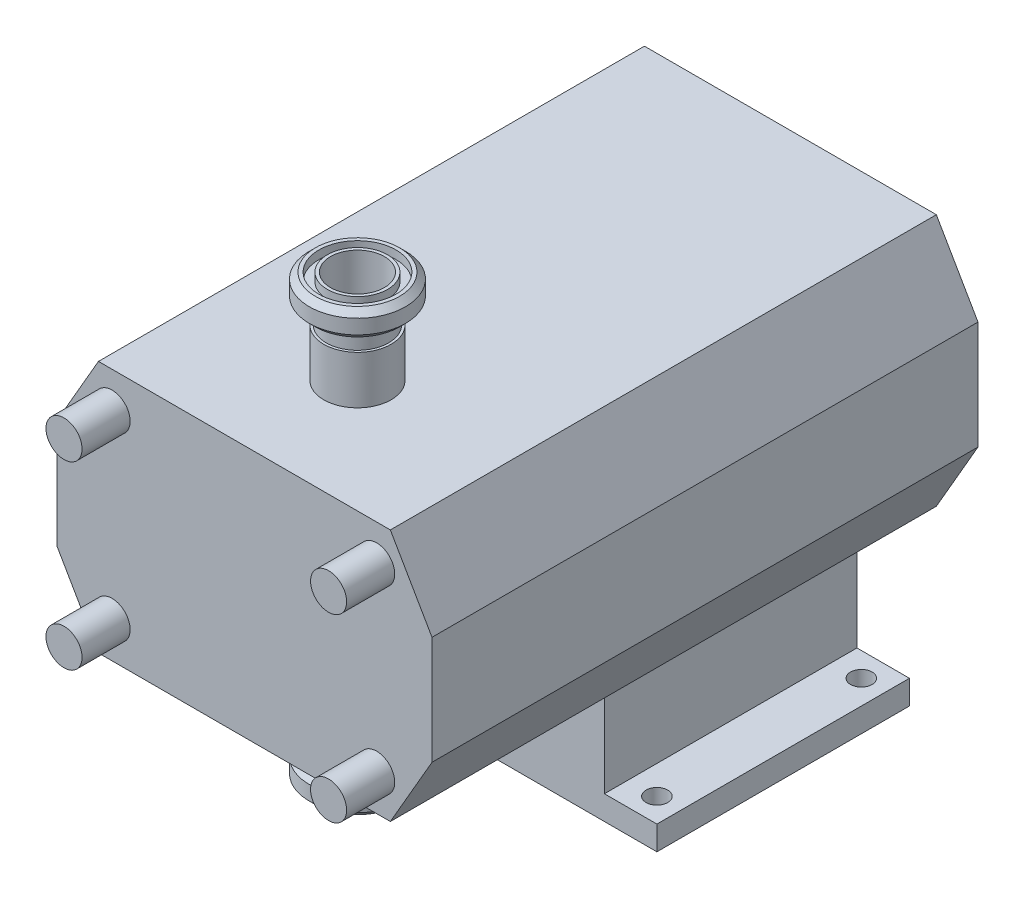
ISO-10303-21;
HEADER;
FILE_DESCRIPTION(('STEP AP214'),'2;1');
FILE_NAME('part.step','',(''),(''),'','','');
FILE_SCHEMA(('AUTOMOTIVE_DESIGN { 1 0 10303 214 1 1 1 1 }'));
ENDSEC;
DATA;
#1=APPLICATION_CONTEXT('core data for automotive mechanical design processes');
#2=APPLICATION_PROTOCOL_DEFINITION('international standard','automotive_design',2000,#1);
#3=PRODUCT_CONTEXT('',#1,'mechanical');
#4=PRODUCT('Part','Part','',(#3));
#5=PRODUCT_RELATED_PRODUCT_CATEGORY('part','',(#4));
#6=PRODUCT_DEFINITION_FORMATION('','',#4);
#7=PRODUCT_DEFINITION_CONTEXT('part definition',#1,'design');
#8=PRODUCT_DEFINITION('design','',#6,#7);
#9=PRODUCT_DEFINITION_SHAPE('','',#8);
#10=(LENGTH_UNIT() NAMED_UNIT(*) SI_UNIT(.MILLI.,.METRE.));
#11=(NAMED_UNIT(*) PLANE_ANGLE_UNIT() SI_UNIT($,.RADIAN.));
#12=(NAMED_UNIT(*) SI_UNIT($,.STERADIAN.) SOLID_ANGLE_UNIT());
#13=UNCERTAINTY_MEASURE_WITH_UNIT(LENGTH_MEASURE(1.E-05),#10,'distance_accuracy_value','');
#14=(GEOMETRIC_REPRESENTATION_CONTEXT(3) GLOBAL_UNCERTAINTY_ASSIGNED_CONTEXT((#13)) GLOBAL_UNIT_ASSIGNED_CONTEXT((#10,
#11,#12)) REPRESENTATION_CONTEXT('',''));
#15=CARTESIAN_POINT('',(0.,0.,0.));
#16=DIRECTION('',(0.,0.,1.));
#17=DIRECTION('',(1.,0.,0.));
#18=AXIS2_PLACEMENT_3D('',#15,#16,#17);
#19=CARTESIAN_POINT('',(-25.,0.,241.732657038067));
#20=DIRECTION('',(0.,0.,1.));
#21=DIRECTION('',(1.,0.,0.));
#22=AXIS2_PLACEMENT_3D('',#19,#20,#21);
#23=CYLINDRICAL_SURFACE('',#22,9.5);
#24=CARTESIAN_POINT('',(-25.,0.,-2.));
#25=DIRECTION('',(0.,0.,1.));
#26=DIRECTION('',(1.,0.,0.));
#27=AXIS2_PLACEMENT_3D('',#24,#25,#26);
#28=CIRCLE('',#27,9.5);
#29=CARTESIAN_POINT('',(-15.5,0.,-2.));
#30=VERTEX_POINT('',#29);
#31=EDGE_CURVE('P0_E277',#30,#30,#28,.T.);
#32=ORIENTED_EDGE('',*,*,#31,.F.);
#33=EDGE_LOOP('',(#32));
#34=FACE_BOUND('',#33,.T.);
#35=DIRECTION('',(0.,0.,1.));
#36=VECTOR('',#35,1.);
#37=CARTESIAN_POINT('',(-15.98612181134,2.99999999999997,241.732657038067));
#38=LINE('',#37,#36);
#39=CARTESIAN_POINT('',(-15.98612181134,3.,-42.));
#40=VERTEX_POINT('',#39);
#41=CARTESIAN_POINT('',(-15.98612181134,3.,-22.));
#42=VERTEX_POINT('',#41);
#43=EDGE_CURVE('P0_E178',#40,#42,#38,.T.);
#44=ORIENTED_EDGE('',*,*,#43,.F.);
#45=CARTESIAN_POINT('',(-25.,0.,-42.));
#46=DIRECTION('',(0.,0.,1.));
#47=DIRECTION('',(1.,0.,0.));
#48=AXIS2_PLACEMENT_3D('',#45,#46,#47);
#49=CIRCLE('',#48,9.5);
#50=CARTESIAN_POINT('',(-15.98612181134,-3.,-42.));
#51=VERTEX_POINT('',#50);
#52=EDGE_CURVE('P0_E176',#40,#51,#49,.T.);
#53=ORIENTED_EDGE('',*,*,#52,.T.);
#54=DIRECTION('',(0.,0.,1.));
#55=VECTOR('',#54,1.);
#56=CARTESIAN_POINT('',(-15.98612181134,-3.00000000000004,241.732657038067));
#57=LINE('',#56,#55);
#58=CARTESIAN_POINT('',(-15.98612181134,-3.00000000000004,-22.));
#59=VERTEX_POINT('',#58);
#60=EDGE_CURVE('P0_E39',#59,#51,#57,.F.);
#61=ORIENTED_EDGE('',*,*,#60,.F.);
#62=CARTESIAN_POINT('',(-15.5,0.,-25.));
#63=CARTESIAN_POINT('',(-15.5000006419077,0.16416708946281,-24.9999991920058));
#64=CARTESIAN_POINT('',(-15.5042954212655,0.328342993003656,-24.9864802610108));
#65=CARTESIAN_POINT('',(-15.5210070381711,0.651888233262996,-24.9329071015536));
#66=CARTESIAN_POINT('',(-15.5334255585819,0.811256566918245,-24.8928473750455));
#67=CARTESIAN_POINT('',(-15.5650291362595,1.12047453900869,-24.787682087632));
#68=CARTESIAN_POINT('',(-15.5842035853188,1.2703386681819,-24.7226157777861));
#69=CARTESIAN_POINT('',(-15.6273427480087,1.55702915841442,-24.5694529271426));
#70=CARTESIAN_POINT('',(-15.6513082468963,1.69385337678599,-24.4813526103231));
#71=CARTESIAN_POINT('',(-15.7023324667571,1.95488615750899,-24.2817053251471));
#72=CARTESIAN_POINT('',(-15.7294596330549,2.07862693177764,-24.1695643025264));
#73=CARTESIAN_POINT('',(-15.7833564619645,2.30589485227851,-23.9262834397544));
#74=CARTESIAN_POINT('',(-15.8101260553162,2.4094181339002,-23.7951399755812));
#75=CARTESIAN_POINT('',(-15.8610140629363,2.59586933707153,-23.5135024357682));
#76=CARTESIAN_POINT('',(-15.8850481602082,2.67820924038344,-23.3626023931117));
#77=CARTESIAN_POINT('',(-15.9267127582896,2.81614778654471,-23.0482150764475));
#78=CARTESIAN_POINT('',(-15.9443449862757,2.87175364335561,-22.8847312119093));
#79=CARTESIAN_POINT('',(-15.9704927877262,2.95292728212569,-22.5551021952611));
#80=CARTESIAN_POINT('',(-15.979271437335,2.97936420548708,-22.3891925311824));
#81=CARTESIAN_POINT('',(-15.9874987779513,3.00416514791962,-22.0550782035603));
#82=CARTESIAN_POINT('',(-15.9869500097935,3.00253681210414,-21.8868741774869));
#83=CARTESIAN_POINT('',(-15.9768164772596,2.97193247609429,-21.5601689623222));
#84=CARTESIAN_POINT('',(-15.9675982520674,2.94406576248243,-21.4015505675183));
#85=CARTESIAN_POINT('',(-15.9417605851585,2.86357596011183,-21.0913669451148));
#86=CARTESIAN_POINT('',(-15.9251403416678,2.81095018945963,-20.9398024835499));
#87=CARTESIAN_POINT('',(-15.8860934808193,2.68166168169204,-20.6454054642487));
#88=CARTESIAN_POINT('',(-15.8635843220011,2.60465367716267,-20.5027359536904));
#89=CARTESIAN_POINT('',(-15.8153331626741,2.4290264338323,-20.2319823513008));
#90=CARTESIAN_POINT('',(-15.7895903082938,2.33040148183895,-20.103902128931));
#91=CARTESIAN_POINT('',(-15.7363062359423,2.10891443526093,-19.859697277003));
#92=CARTESIAN_POINT('',(-15.7087370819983,1.98513792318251,-19.7444065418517));
#93=CARTESIAN_POINT('',(-15.6559621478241,1.71966506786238,-19.5360135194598));
#94=CARTESIAN_POINT('',(-15.6307565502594,1.57796734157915,-19.4429129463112));
#95=CARTESIAN_POINT('',(-15.5852743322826,1.27904248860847,-19.2809619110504));
#96=CARTESIAN_POINT('',(-15.5650393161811,1.12169880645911,-19.2123141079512));
#97=CARTESIAN_POINT('',(-15.5320787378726,0.796908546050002,-19.102710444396));
#98=CARTESIAN_POINT('',(-15.5193508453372,0.629465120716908,-19.0617459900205));
#99=CARTESIAN_POINT('',(-15.5032152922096,0.296303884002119,-19.0101010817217));
#100=CARTESIAN_POINT('',(-15.4994604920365,0.130777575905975,-18.9982920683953));
#101=CARTESIAN_POINT('',(-15.5006652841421,-0.199911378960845,-19.0021062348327));
#102=CARTESIAN_POINT('',(-15.5056235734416,-0.365074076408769,-19.017725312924));
#103=CARTESIAN_POINT('',(-15.5234691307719,-0.685969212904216,-19.0750481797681));
#104=CARTESIAN_POINT('',(-15.5361511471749,-0.841834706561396,-19.1160771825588));
#105=CARTESIAN_POINT('',(-15.5679556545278,-1.14442314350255,-19.2222287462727));
#106=CARTESIAN_POINT('',(-15.5870789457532,-1.2911449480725,-19.2873543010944));
#107=CARTESIAN_POINT('',(-15.6303910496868,-1.57531276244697,-19.4416461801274));
#108=CARTESIAN_POINT('',(-15.6546933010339,-1.71244019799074,-19.5313665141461));
#109=CARTESIAN_POINT('',(-15.7055878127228,-1.97006979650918,-19.7316386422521));
#110=CARTESIAN_POINT('',(-15.7321807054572,-2.09056734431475,-19.8421961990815));
#111=CARTESIAN_POINT('',(-15.7860170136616,-2.31658675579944,-20.0863131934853));
#112=CARTESIAN_POINT('',(-15.813243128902,-2.42130400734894,-20.2206231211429));
#113=CARTESIAN_POINT('',(-15.8641405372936,-2.60679013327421,-20.5055000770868));
#114=CARTESIAN_POINT('',(-15.8878118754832,-2.68755931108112,-20.6560668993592));
#115=CARTESIAN_POINT('',(-15.9286607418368,-2.82237097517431,-20.9689238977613));
#116=CARTESIAN_POINT('',(-15.9458617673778,-2.87651039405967,-21.1311690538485));
#117=CARTESIAN_POINT('',(-15.9716606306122,-2.95649944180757,-21.4631296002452));
#118=CARTESIAN_POINT('',(-15.9802618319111,-2.9823601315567,-21.6328420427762));
#119=CARTESIAN_POINT('',(-15.9875316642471,-3.0042524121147,-21.9664938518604));
#120=CARTESIAN_POINT('',(-15.9866406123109,-3.00160628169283,-22.1303379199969));
#121=CARTESIAN_POINT('',(-15.9760989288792,-2.96976166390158,-22.4551233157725));
#122=CARTESIAN_POINT('',(-15.9664487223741,-2.94056446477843,-22.6160647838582));
#123=CARTESIAN_POINT('',(-15.9397869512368,-2.8573397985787,-22.928056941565));
#124=CARTESIAN_POINT('',(-15.9228900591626,-2.80369834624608,-23.0792211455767));
#125=CARTESIAN_POINT('',(-15.8836701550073,-2.67341300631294,-23.3705239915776));
#126=CARTESIAN_POINT('',(-15.8613460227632,-2.59676436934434,-23.5106603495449));
#127=CARTESIAN_POINT('',(-15.8126776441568,-2.4190708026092,-23.781973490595));
#128=CARTESIAN_POINT('',(-15.7862086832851,-2.31717569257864,-23.9125710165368));
#129=CARTESIAN_POINT('',(-15.7327983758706,-2.0933684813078,-24.1552416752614));
#130=CARTESIAN_POINT('',(-15.705856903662,-1.97145098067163,-24.2673097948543));
#131=CARTESIAN_POINT('',(-15.6534511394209,-1.7061326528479,-24.4735138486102));
#132=CARTESIAN_POINT('',(-15.6280668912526,-1.56214764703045,-24.5669207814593));
#133=CARTESIAN_POINT('',(-15.5826524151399,-1.25971894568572,-24.728083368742));
#134=CARTESIAN_POINT('',(-15.5626201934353,-1.10128066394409,-24.7958485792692));
#135=CARTESIAN_POINT('',(-15.531467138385,-0.787271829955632,-24.8991975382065));
#136=CARTESIAN_POINT('',(-15.5197707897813,-0.632450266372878,-24.9368877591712));
#137=CARTESIAN_POINT('',(-15.5040377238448,-0.318421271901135,-24.9872867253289));
#138=CARTESIAN_POINT('',(-15.4999993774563,-0.159214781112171,-25.00000078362));
#139=CARTESIAN_POINT('',(-15.5,0.,-25.));
#140=B_SPLINE_CURVE_WITH_KNOTS('',3,(#62,#63,#64,#65,#66,#67,#68,#69,#70,#71,#72,#73,#74,#75,
#76,#77,#78,#79,#80,#81,#82,#83,#84,#85,#86,#87,#88,#89,#90,#91,#92,#93,#94,#95,#96,#97,#98,#99,
#100,#101,#102,#103,#104,#105,#106,#107,#108,#109,#110,#111,#112,#113,#114,#115,#116,#117,#118,
#119,#120,#121,#122,#123,#124,#125,#126,#127,#128,#129,#130,#131,#132,#133,#134,#135,#136,#137,
#138,#139),.UNSPECIFIED.,.T.,.F.,(4,2,2,2,2,2,2,2,2,2,2,2,2,2,2,2,2,2,2,2,2,2,2,2,2,2,2,2,2,2,2,
2,2,2,2,2,2,2,4),(0.,0.491915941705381,0.983933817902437,1.47518254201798,1.96651184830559,
2.47177433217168,2.97713330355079,3.49529138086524,4.0133095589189,4.51543663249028,
5.01742692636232,5.49910423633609,5.98083373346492,6.46971527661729,6.95872618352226,
7.47049694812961,7.98230723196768,8.49826565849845,9.01406383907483,9.50955937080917,
10.0049808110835,10.487778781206,10.9706367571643,11.4654198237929,11.9603399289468,
12.4753133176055,12.9902801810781,13.5033584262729,14.0162359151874,14.5054301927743,
14.9946007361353,15.4763007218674,15.9581002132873,16.4590917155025,16.9602185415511,
17.4781824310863,17.9959530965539,18.4731312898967,18.9502079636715),.UNSPECIFIED.);
#141=EDGE_CURVE('P0_E11',#42,#59,#140,.T.);
#142=ORIENTED_EDGE('',*,*,#141,.F.);
#143=EDGE_LOOP('',(#44,#53,#61,#142));
#144=FACE_BOUND('',#143,.T.);
#145=ADVANCED_FACE('P0_F17',(#34,#144),#23,.T.);
#146=CARTESIAN_POINT('',(-60.6794919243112,-52.5,227.));
#147=DIRECTION('',(0.,1.,0.));
#148=DIRECTION('',(-1.,0.,0.));
#149=AXIS2_PLACEMENT_3D('',#146,#147,#148);
#150=PLANE('',#149);
#151=CARTESIAN_POINT('',(0.,-52.5,180.));
#152=DIRECTION('',(0.,1.,0.));
#153=DIRECTION('',(-1.,0.,0.));
#154=AXIS2_PLACEMENT_3D('',#151,#152,#153);
#155=CIRCLE('',#154,14.);
#156=CARTESIAN_POINT('',(-14.,-52.5,180.));
#157=VERTEX_POINT('',#156);
#158=EDGE_CURVE('P0_E192',#157,#157,#155,.T.);
#159=ORIENTED_EDGE('',*,*,#158,.T.);
#160=EDGE_LOOP('',(#159));
#161=FACE_BOUND('',#160,.T.);
#162=DIRECTION('',(1.,0.,0.));
#163=VECTOR('',#162,1.);
#164=CARTESIAN_POINT('',(-60.6794919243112,-52.5,0.));
#165=LINE('',#164,#163);
#166=CARTESIAN_POINT('',(-60.6794919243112,-52.5,0.));
#167=VERTEX_POINT('',#166);
#168=CARTESIAN_POINT('',(60.6794919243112,-52.5,0.));
#169=VERTEX_POINT('',#168);
#170=EDGE_CURVE('P0_E337',#167,#169,#165,.T.);
#171=ORIENTED_EDGE('',*,*,#170,.T.);
#172=DIRECTION('',(0.,0.,-1.));
#173=VECTOR('',#172,1.);
#174=CARTESIAN_POINT('',(60.6794919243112,-52.5,227.));
#175=LINE('',#174,#173);
#176=CARTESIAN_POINT('',(60.6794919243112,-52.5,227.));
#177=VERTEX_POINT('',#176);
#178=EDGE_CURVE('P0_E347',#177,#169,#175,.T.);
#179=ORIENTED_EDGE('',*,*,#178,.F.);
#180=DIRECTION('',(1.,0.,0.));
#181=VECTOR('',#180,1.);
#182=CARTESIAN_POINT('',(-60.6794919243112,-52.5,227.));
#183=LINE('',#182,#181);
#184=CARTESIAN_POINT('',(-60.6794919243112,-52.5,227.));
#185=VERTEX_POINT('',#184);
#186=EDGE_CURVE('P0_E320',#185,#177,#183,.T.);
#187=ORIENTED_EDGE('',*,*,#186,.F.);
#188=DIRECTION('',(0.,0.,-1.));
#189=VECTOR('',#188,1.);
#190=CARTESIAN_POINT('',(-60.6794919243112,-52.5,227.));
#191=LINE('',#190,#189);
#192=EDGE_CURVE('P0_E350',#185,#167,#191,.T.);
#193=ORIENTED_EDGE('',*,*,#192,.T.);
#194=EDGE_LOOP('',(#171,#179,#187,#193));
#195=FACE_BOUND('',#194,.T.);
#196=DIRECTION('',(1.,0.,0.));
#197=VECTOR('',#196,1.);
#198=CARTESIAN_POINT('',(45.6794919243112,-52.5,18.));
#199=LINE('',#198,#197);
#200=CARTESIAN_POINT('',(-45.6794919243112,-52.5,18.));
#201=VERTEX_POINT('',#200);
#202=CARTESIAN_POINT('',(45.6794919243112,-52.5,18.));
#203=VERTEX_POINT('',#202);
#204=EDGE_CURVE('P0_E220',#201,#203,#199,.T.);
#205=ORIENTED_EDGE('',*,*,#204,.F.);
#206=DIRECTION('',(0.,0.,1.));
#207=VECTOR('',#206,1.);
#208=CARTESIAN_POINT('',(-45.6794919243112,-52.5,18.));
#209=LINE('',#208,#207);
#210=CARTESIAN_POINT('',(-45.6794919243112,-52.5,123.));
#211=VERTEX_POINT('',#210);
#212=EDGE_CURVE('P0_E238',#201,#211,#209,.T.);
#213=ORIENTED_EDGE('',*,*,#212,.T.);
#214=DIRECTION('',(1.,0.,0.));
#215=VECTOR('',#214,1.);
#216=CARTESIAN_POINT('',(45.6794919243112,-52.5,123.));
#217=LINE('',#216,#215);
#218=CARTESIAN_POINT('',(45.6794919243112,-52.5,123.));
#219=VERTEX_POINT('',#218);
#220=EDGE_CURVE('P0_E219',#211,#219,#217,.T.);
#221=ORIENTED_EDGE('',*,*,#220,.T.);
#222=DIRECTION('',(0.,0.,1.));
#223=VECTOR('',#222,1.);
#224=CARTESIAN_POINT('',(45.6794919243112,-52.5,18.));
#225=LINE('',#224,#223);
#226=EDGE_CURVE('P0_E274',#203,#219,#225,.T.);
#227=ORIENTED_EDGE('',*,*,#226,.F.);
#228=EDGE_LOOP('',(#205,#213,#221,#227));
#229=FACE_BOUND('',#228,.T.);
#230=ADVANCED_FACE('P0_F393',(#161,#195,#229),#150,.F.);
#231=CARTESIAN_POINT('',(90.9903810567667,0.,0.));
#232=DIRECTION('',(0.,0.,1.));
#233=DIRECTION('',(1.,0.,0.));
#234=AXIS2_PLACEMENT_3D('',#231,#232,#233);
#235=PLANE('',#234);
#236=DIRECTION('',(-0.500000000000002,0.866025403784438,0.));
#237=VECTOR('',#236,1.);
#238=CARTESIAN_POINT('',(60.6794919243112,52.5,0.));
#239=LINE('',#238,#237);
#240=CARTESIAN_POINT('',(78.,22.5,0.));
#241=VERTEX_POINT('',#240);
#242=CARTESIAN_POINT('',(60.6794919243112,52.5,0.));
#243=VERTEX_POINT('',#242);
#244=EDGE_CURVE('P0_E305',#241,#243,#239,.T.);
#245=ORIENTED_EDGE('',*,*,#244,.F.);
#246=DIRECTION('',(0.,1.,0.));
#247=VECTOR('',#246,1.);
#248=CARTESIAN_POINT('',(78.,22.5,0.));
#249=LINE('',#248,#247);
#250=CARTESIAN_POINT('',(78.,-22.5,0.));
#251=VERTEX_POINT('',#250);
#252=EDGE_CURVE('P0_E312',#251,#241,#249,.T.);
#253=ORIENTED_EDGE('',*,*,#252,.F.);
#254=DIRECTION('',(0.500000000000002,0.866025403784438,0.));
#255=VECTOR('',#254,1.);
#256=CARTESIAN_POINT('',(60.6794919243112,-52.5,0.));
#257=LINE('',#256,#255);
#258=EDGE_CURVE('P0_E339',#169,#251,#257,.T.);
#259=ORIENTED_EDGE('',*,*,#258,.F.);
#260=ORIENTED_EDGE('',*,*,#170,.F.);
#261=DIRECTION('',(0.500000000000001,-0.866025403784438,0.));
#262=VECTOR('',#261,1.);
#263=CARTESIAN_POINT('',(-60.6794919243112,-52.5,0.));
#264=LINE('',#263,#262);
#265=CARTESIAN_POINT('',(-78.,-22.5,0.));
#266=VERTEX_POINT('',#265);
#267=EDGE_CURVE('P0_E335',#266,#167,#264,.T.);
#268=ORIENTED_EDGE('',*,*,#267,.F.);
#269=DIRECTION('',(0.,-1.,0.));
#270=VECTOR('',#269,1.);
#271=CARTESIAN_POINT('',(-78.,22.5,0.));
#272=LINE('',#271,#270);
#273=CARTESIAN_POINT('',(-78.,22.5,0.));
#274=VERTEX_POINT('',#273);
#275=EDGE_CURVE('P0_E333',#274,#266,#272,.T.);
#276=ORIENTED_EDGE('',*,*,#275,.F.);
#277=DIRECTION('',(-0.500000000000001,-0.866025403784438,0.));
#278=VECTOR('',#277,1.);
#279=CARTESIAN_POINT('',(-60.6794919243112,52.5,0.));
#280=LINE('',#279,#278);
#281=CARTESIAN_POINT('',(-60.6794919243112,52.5,0.));
#282=VERTEX_POINT('',#281);
#283=EDGE_CURVE('P0_E331',#282,#274,#280,.T.);
#284=ORIENTED_EDGE('',*,*,#283,.F.);
#285=DIRECTION('',(-1.,0.,0.));
#286=VECTOR('',#285,1.);
#287=CARTESIAN_POINT('',(-60.6794919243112,52.5,0.));
#288=LINE('',#287,#286);
#289=EDGE_CURVE('P0_E329',#243,#282,#288,.T.);
#290=ORIENTED_EDGE('',*,*,#289,.F.);
#291=EDGE_LOOP('',(#245,#253,#259,#260,#268,#276,#284,#290));
#292=FACE_BOUND('',#291,.T.);
#293=CARTESIAN_POINT('',(-25.,0.,0.));
#294=DIRECTION('',(0.,0.,1.));
#295=DIRECTION('',(1.,0.,0.));
#296=AXIS2_PLACEMENT_3D('',#293,#294,#295);
#297=CIRCLE('',#296,12.5);
#298=CARTESIAN_POINT('',(-12.5,0.,0.));
#299=VERTEX_POINT('',#298);
#300=EDGE_CURVE('P0_E29',#299,#299,#297,.F.);
#301=ORIENTED_EDGE('',*,*,#300,.F.);
#302=EDGE_LOOP('',(#301));
#303=FACE_BOUND('',#302,.T.);
#304=ADVANCED_FACE('P0_F399',(#292,#303),#235,.F.);
#305=CARTESIAN_POINT('',(90.9903810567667,0.,227.));
#306=DIRECTION('',(0.,0.,1.));
#307=DIRECTION('',(1.,0.,0.));
#308=AXIS2_PLACEMENT_3D('',#305,#306,#307);
#309=PLANE('',#308);
#310=CARTESIAN_POINT('',(55.,-37.5,227.));
#311=DIRECTION('',(0.,0.,1.));
#312=DIRECTION('',(1.,0.,0.));
#313=AXIS2_PLACEMENT_3D('',#310,#311,#312);
#314=CIRCLE('',#313,7.49999999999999);
#315=CARTESIAN_POINT('',(62.5,-37.5,227.));
#316=VERTEX_POINT('',#315);
#317=EDGE_CURVE('P0_E287',#316,#316,#314,.T.);
#318=ORIENTED_EDGE('',*,*,#317,.F.);
#319=EDGE_LOOP('',(#318));
#320=FACE_BOUND('',#319,.T.);
#321=CARTESIAN_POINT('',(-55.,37.5,227.));
#322=DIRECTION('',(0.,0.,1.));
#323=DIRECTION('',(1.,0.,0.));
#324=AXIS2_PLACEMENT_3D('',#321,#322,#323);
#325=CIRCLE('',#324,7.5);
#326=CARTESIAN_POINT('',(-47.5,37.5,227.));
#327=VERTEX_POINT('',#326);
#328=EDGE_CURVE('P0_E299',#327,#327,#325,.T.);
#329=ORIENTED_EDGE('',*,*,#328,.F.);
#330=EDGE_LOOP('',(#329));
#331=FACE_BOUND('',#330,.T.);
#332=DIRECTION('',(-0.500000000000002,0.866025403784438,0.));
#333=VECTOR('',#332,1.);
#334=CARTESIAN_POINT('',(60.6794919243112,52.5,227.));
#335=LINE('',#334,#333);
#336=CARTESIAN_POINT('',(78.,22.5,227.));
#337=VERTEX_POINT('',#336);
#338=CARTESIAN_POINT('',(60.6794919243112,52.5,227.));
#339=VERTEX_POINT('',#338);
#340=EDGE_CURVE('P0_E308',#337,#339,#335,.T.);
#341=ORIENTED_EDGE('',*,*,#340,.T.);
#342=DIRECTION('',(-1.,0.,0.));
#343=VECTOR('',#342,1.);
#344=CARTESIAN_POINT('',(-60.6794919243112,52.5,227.));
#345=LINE('',#344,#343);
#346=CARTESIAN_POINT('',(-60.6794919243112,52.5,227.));
#347=VERTEX_POINT('',#346);
#348=EDGE_CURVE('P0_E311',#339,#347,#345,.T.);
#349=ORIENTED_EDGE('',*,*,#348,.T.);
#350=DIRECTION('',(-0.500000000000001,-0.866025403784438,0.));
#351=VECTOR('',#350,1.);
#352=CARTESIAN_POINT('',(-60.6794919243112,52.5,227.));
#353=LINE('',#352,#351);
#354=CARTESIAN_POINT('',(-78.,22.5,227.));
#355=VERTEX_POINT('',#354);
#356=EDGE_CURVE('P0_E314',#347,#355,#353,.T.);
#357=ORIENTED_EDGE('',*,*,#356,.T.);
#358=DIRECTION('',(0.,-1.,0.));
#359=VECTOR('',#358,1.);
#360=CARTESIAN_POINT('',(-78.,22.5,227.));
#361=LINE('',#360,#359);
#362=CARTESIAN_POINT('',(-78.,-22.5,227.));
#363=VERTEX_POINT('',#362);
#364=EDGE_CURVE('P0_E316',#355,#363,#361,.T.);
#365=ORIENTED_EDGE('',*,*,#364,.T.);
#366=DIRECTION('',(0.500000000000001,-0.866025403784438,0.));
#367=VECTOR('',#366,1.);
#368=CARTESIAN_POINT('',(-60.6794919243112,-52.5,227.));
#369=LINE('',#368,#367);
#370=EDGE_CURVE('P0_E318',#363,#185,#369,.T.);
#371=ORIENTED_EDGE('',*,*,#370,.T.);
#372=ORIENTED_EDGE('',*,*,#186,.T.);
#373=DIRECTION('',(0.500000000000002,0.866025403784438,0.));
#374=VECTOR('',#373,1.);
#375=CARTESIAN_POINT('',(60.6794919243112,-52.5,227.));
#376=LINE('',#375,#374);
#377=CARTESIAN_POINT('',(78.,-22.5,227.));
#378=VERTEX_POINT('',#377);
#379=EDGE_CURVE('P0_E322',#177,#378,#376,.T.);
#380=ORIENTED_EDGE('',*,*,#379,.T.);
#381=DIRECTION('',(0.,1.,0.));
#382=VECTOR('',#381,1.);
#383=CARTESIAN_POINT('',(78.,22.5,227.));
#384=LINE('',#383,#382);
#385=EDGE_CURVE('P0_E324',#378,#337,#384,.T.);
#386=ORIENTED_EDGE('',*,*,#385,.T.);
#387=EDGE_LOOP('',(#341,#349,#357,#365,#371,#372,#380,#386));
#388=FACE_BOUND('',#387,.T.);
#389=CARTESIAN_POINT('',(55.,37.5,227.));
#390=DIRECTION('',(0.,0.,1.));
#391=DIRECTION('',(1.,0.,0.));
#392=AXIS2_PLACEMENT_3D('',#389,#390,#391);
#393=CIRCLE('',#392,7.49999999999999);
#394=CARTESIAN_POINT('',(62.5,37.5,227.));
#395=VERTEX_POINT('',#394);
#396=EDGE_CURVE('P0_E293',#395,#395,#393,.T.);
#397=ORIENTED_EDGE('',*,*,#396,.F.);
#398=EDGE_LOOP('',(#397));
#399=FACE_BOUND('',#398,.T.);
#400=CARTESIAN_POINT('',(-55.,-37.5,227.));
#401=DIRECTION('',(0.,0.,1.));
#402=DIRECTION('',(1.,0.,0.));
#403=AXIS2_PLACEMENT_3D('',#400,#401,#402);
#404=CIRCLE('',#403,7.5);
#405=CARTESIAN_POINT('',(-47.5,-37.5,227.));
#406=VERTEX_POINT('',#405);
#407=EDGE_CURVE('P0_E283',#406,#406,#404,.T.);
#408=ORIENTED_EDGE('',*,*,#407,.F.);
#409=EDGE_LOOP('',(#408));
#410=FACE_BOUND('',#409,.T.);
#411=ADVANCED_FACE('P0_F448',(#320,#331,#388,#399,#410),#309,.T.);
#412=CARTESIAN_POINT('',(60.6794919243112,52.5,227.));
#413=DIRECTION('',(-0.866025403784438,-0.500000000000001,0.));
#414=DIRECTION('',(0.500000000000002,-0.866025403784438,0.));
#415=AXIS2_PLACEMENT_3D('',#412,#413,#414);
#416=PLANE('',#415);
#417=ORIENTED_EDGE('',*,*,#244,.T.);
#418=DIRECTION('',(0.,0.,-1.));
#419=VECTOR('',#418,1.);
#420=CARTESIAN_POINT('',(60.6794919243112,52.5,227.));
#421=LINE('',#420,#419);
#422=EDGE_CURVE('P0_E362',#339,#243,#421,.T.);
#423=ORIENTED_EDGE('',*,*,#422,.F.);
#424=ORIENTED_EDGE('',*,*,#340,.F.);
#425=DIRECTION('',(0.,0.,-1.));
#426=VECTOR('',#425,1.);
#427=CARTESIAN_POINT('',(78.,22.5,227.));
#428=LINE('',#427,#426);
#429=EDGE_CURVE('P0_E326',#337,#241,#428,.T.);
#430=ORIENTED_EDGE('',*,*,#429,.T.);
#431=EDGE_LOOP('',(#417,#423,#424,#430));
#432=FACE_BOUND('',#431,.T.);
#433=ADVANCED_FACE('P0_F19',(#432),#416,.F.);
#434=CARTESIAN_POINT('',(-60.6794919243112,52.5,227.));
#435=DIRECTION('',(0.,-1.,0.));
#436=DIRECTION('',(1.,0.,0.));
#437=AXIS2_PLACEMENT_3D('',#434,#435,#436);
#438=PLANE('',#437);
#439=CARTESIAN_POINT('',(0.,52.5,180.));
#440=DIRECTION('',(0.,-1.,0.));
#441=DIRECTION('',(1.,0.,0.));
#442=AXIS2_PLACEMENT_3D('',#439,#440,#441);
#443=CIRCLE('',#442,14.);
#444=CARTESIAN_POINT('',(14.,52.5,180.));
#445=VERTEX_POINT('',#444);
#446=EDGE_CURVE('P0_E191',#445,#445,#443,.T.);
#447=ORIENTED_EDGE('',*,*,#446,.T.);
#448=EDGE_LOOP('',(#447));
#449=FACE_BOUND('',#448,.T.);
#450=ORIENTED_EDGE('',*,*,#289,.T.);
#451=DIRECTION('',(0.,0.,-1.));
#452=VECTOR('',#451,1.);
#453=CARTESIAN_POINT('',(-60.6794919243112,52.5,227.));
#454=LINE('',#453,#452);
#455=EDGE_CURVE('P0_E359',#347,#282,#454,.T.);
#456=ORIENTED_EDGE('',*,*,#455,.F.);
#457=ORIENTED_EDGE('',*,*,#348,.F.);
#458=ORIENTED_EDGE('',*,*,#422,.T.);
#459=EDGE_LOOP('',(#450,#456,#457,#458));
#460=FACE_BOUND('',#459,.T.);
#461=ADVANCED_FACE('P0_F369',(#449,#460),#438,.F.);
#462=CARTESIAN_POINT('',(-60.6794919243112,52.5,227.));
#463=DIRECTION('',(0.866025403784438,-0.500000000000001,0.));
#464=DIRECTION('',(0.500000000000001,0.866025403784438,0.));
#465=AXIS2_PLACEMENT_3D('',#462,#463,#464);
#466=PLANE('',#465);
#467=ORIENTED_EDGE('',*,*,#283,.T.);
#468=DIRECTION('',(0.,0.,-1.));
#469=VECTOR('',#468,1.);
#470=CARTESIAN_POINT('',(-78.,22.5,227.));
#471=LINE('',#470,#469);
#472=EDGE_CURVE('P0_E356',#355,#274,#471,.T.);
#473=ORIENTED_EDGE('',*,*,#472,.F.);
#474=ORIENTED_EDGE('',*,*,#356,.F.);
#475=ORIENTED_EDGE('',*,*,#455,.T.);
#476=EDGE_LOOP('',(#467,#473,#474,#475));
#477=FACE_BOUND('',#476,.T.);
#478=ADVANCED_FACE('P0_F469',(#477),#466,.F.);
#479=CARTESIAN_POINT('',(-78.,22.5,227.));
#480=DIRECTION('',(1.,0.,0.));
#481=DIRECTION('',(0.,0.,-1.));
#482=AXIS2_PLACEMENT_3D('',#479,#480,#481);
#483=PLANE('',#482);
#484=ORIENTED_EDGE('',*,*,#275,.T.);
#485=DIRECTION('',(0.,0.,-1.));
#486=VECTOR('',#485,1.);
#487=CARTESIAN_POINT('',(-78.,-22.5,227.));
#488=LINE('',#487,#486);
#489=EDGE_CURVE('P0_E353',#363,#266,#488,.T.);
#490=ORIENTED_EDGE('',*,*,#489,.F.);
#491=ORIENTED_EDGE('',*,*,#364,.F.);
#492=ORIENTED_EDGE('',*,*,#472,.T.);
#493=EDGE_LOOP('',(#484,#490,#491,#492));
#494=FACE_BOUND('',#493,.T.);
#495=ADVANCED_FACE('P0_F465',(#494),#483,.F.);
#496=CARTESIAN_POINT('',(-60.6794919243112,-52.5,227.));
#497=DIRECTION('',(0.866025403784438,0.500000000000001,0.));
#498=DIRECTION('',(-0.500000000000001,0.866025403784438,0.));
#499=AXIS2_PLACEMENT_3D('',#496,#497,#498);
#500=PLANE('',#499);
#501=ORIENTED_EDGE('',*,*,#267,.T.);
#502=ORIENTED_EDGE('',*,*,#192,.F.);
#503=ORIENTED_EDGE('',*,*,#370,.F.);
#504=ORIENTED_EDGE('',*,*,#489,.T.);
#505=EDGE_LOOP('',(#501,#502,#503,#504));
#506=FACE_BOUND('',#505,.T.);
#507=ADVANCED_FACE('P0_F460',(#506),#500,.F.);
#508=CARTESIAN_POINT('',(60.6794919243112,-52.5,227.));
#509=DIRECTION('',(-0.866025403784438,0.500000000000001,0.));
#510=DIRECTION('',(-0.500000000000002,-0.866025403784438,0.));
#511=AXIS2_PLACEMENT_3D('',#508,#509,#510);
#512=PLANE('',#511);
#513=ORIENTED_EDGE('',*,*,#258,.T.);
#514=DIRECTION('',(0.,0.,-1.));
#515=VECTOR('',#514,1.);
#516=CARTESIAN_POINT('',(78.,-22.5,227.));
#517=LINE('',#516,#515);
#518=EDGE_CURVE('P0_E344',#378,#251,#517,.T.);
#519=ORIENTED_EDGE('',*,*,#518,.F.);
#520=ORIENTED_EDGE('',*,*,#379,.F.);
#521=ORIENTED_EDGE('',*,*,#178,.T.);
#522=EDGE_LOOP('',(#513,#519,#520,#521));
#523=FACE_BOUND('',#522,.T.);
#524=ADVANCED_FACE('P0_F457',(#523),#512,.F.);
#525=CARTESIAN_POINT('',(78.,22.5,227.));
#526=DIRECTION('',(-1.,0.,0.));
#527=DIRECTION('',(0.,0.,1.));
#528=AXIS2_PLACEMENT_3D('',#525,#526,#527);
#529=PLANE('',#528);
#530=ORIENTED_EDGE('',*,*,#252,.T.);
#531=ORIENTED_EDGE('',*,*,#429,.F.);
#532=ORIENTED_EDGE('',*,*,#385,.F.);
#533=ORIENTED_EDGE('',*,*,#518,.T.);
#534=EDGE_LOOP('',(#530,#531,#532,#533));
#535=FACE_BOUND('',#534,.T.);
#536=ADVANCED_FACE('P0_F446',(#535),#529,.F.);
#537=CARTESIAN_POINT('',(-55.,37.5,247.));
#538=DIRECTION('',(0.,0.,-1.));
#539=DIRECTION('',(-1.,0.,0.));
#540=AXIS2_PLACEMENT_3D('',#537,#538,#539);
#541=CYLINDRICAL_SURFACE('',#540,7.5);
#542=CARTESIAN_POINT('',(-55.,37.5,247.));
#543=DIRECTION('',(0.,0.,1.));
#544=DIRECTION('',(1.,0.,0.));
#545=AXIS2_PLACEMENT_3D('',#542,#543,#544);
#546=CIRCLE('',#545,7.5);
#547=CARTESIAN_POINT('',(-47.5,37.5,247.));
#548=VERTEX_POINT('',#547);
#549=EDGE_CURVE('P0_E302',#548,#548,#546,.T.);
#550=ORIENTED_EDGE('',*,*,#549,.F.);
#551=EDGE_LOOP('',(#550));
#552=FACE_BOUND('',#551,.T.);
#553=ORIENTED_EDGE('',*,*,#328,.T.);
#554=EDGE_LOOP('',(#553));
#555=FACE_BOUND('',#554,.T.);
#556=ADVANCED_FACE('P0_F442',(#552,#555),#541,.T.);
#557=CARTESIAN_POINT('',(-55.,37.5,247.));
#558=DIRECTION('',(0.,0.,1.));
#559=DIRECTION('',(1.,0.,0.));
#560=AXIS2_PLACEMENT_3D('',#557,#558,#559);
#561=PLANE('',#560);
#562=ORIENTED_EDGE('',*,*,#549,.T.);
#563=EDGE_LOOP('',(#562));
#564=FACE_BOUND('',#563,.T.);
#565=ADVANCED_FACE('P0_F438',(#564),#561,.T.);
#566=CARTESIAN_POINT('',(55.,37.5,247.));
#567=DIRECTION('',(0.,0.,-1.));
#568=DIRECTION('',(-1.,0.,0.));
#569=AXIS2_PLACEMENT_3D('',#566,#567,#568);
#570=CYLINDRICAL_SURFACE('',#569,7.49999999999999);
#571=CARTESIAN_POINT('',(55.,37.5,247.));
#572=DIRECTION('',(0.,0.,1.));
#573=DIRECTION('',(1.,0.,0.));
#574=AXIS2_PLACEMENT_3D('',#571,#572,#573);
#575=CIRCLE('',#574,7.49999999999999);
#576=CARTESIAN_POINT('',(62.5,37.5,247.));
#577=VERTEX_POINT('',#576);
#578=EDGE_CURVE('P0_E296',#577,#577,#575,.T.);
#579=ORIENTED_EDGE('',*,*,#578,.F.);
#580=EDGE_LOOP('',(#579));
#581=FACE_BOUND('',#580,.T.);
#582=ORIENTED_EDGE('',*,*,#396,.T.);
#583=EDGE_LOOP('',(#582));
#584=FACE_BOUND('',#583,.T.);
#585=ADVANCED_FACE('P0_F434',(#581,#584),#570,.T.);
#586=CARTESIAN_POINT('',(55.,37.5,247.));
#587=DIRECTION('',(0.,0.,1.));
#588=DIRECTION('',(1.,0.,0.));
#589=AXIS2_PLACEMENT_3D('',#586,#587,#588);
#590=PLANE('',#589);
#591=ORIENTED_EDGE('',*,*,#578,.T.);
#592=EDGE_LOOP('',(#591));
#593=FACE_BOUND('',#592,.T.);
#594=ADVANCED_FACE('P0_F430',(#593),#590,.T.);
#595=CARTESIAN_POINT('',(55.,-37.5,247.));
#596=DIRECTION('',(0.,0.,-1.));
#597=DIRECTION('',(-1.,0.,0.));
#598=AXIS2_PLACEMENT_3D('',#595,#596,#597);
#599=CYLINDRICAL_SURFACE('',#598,7.49999999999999);
#600=CARTESIAN_POINT('',(55.,-37.5,247.));
#601=DIRECTION('',(0.,0.,1.));
#602=DIRECTION('',(1.,0.,0.));
#603=AXIS2_PLACEMENT_3D('',#600,#601,#602);
#604=CIRCLE('',#603,7.49999999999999);
#605=CARTESIAN_POINT('',(62.5,-37.5,247.));
#606=VERTEX_POINT('',#605);
#607=EDGE_CURVE('P0_E290',#606,#606,#604,.T.);
#608=ORIENTED_EDGE('',*,*,#607,.F.);
#609=EDGE_LOOP('',(#608));
#610=FACE_BOUND('',#609,.T.);
#611=ORIENTED_EDGE('',*,*,#317,.T.);
#612=EDGE_LOOP('',(#611));
#613=FACE_BOUND('',#612,.T.);
#614=ADVANCED_FACE('P0_F426',(#610,#613),#599,.T.);
#615=CARTESIAN_POINT('',(55.,-37.5,247.));
#616=DIRECTION('',(0.,0.,1.));
#617=DIRECTION('',(1.,0.,0.));
#618=AXIS2_PLACEMENT_3D('',#615,#616,#617);
#619=PLANE('',#618);
#620=ORIENTED_EDGE('',*,*,#607,.T.);
#621=EDGE_LOOP('',(#620));
#622=FACE_BOUND('',#621,.T.);
#623=ADVANCED_FACE('P0_F422',(#622),#619,.T.);
#624=CARTESIAN_POINT('',(-55.,-37.5,247.));
#625=DIRECTION('',(0.,0.,-1.));
#626=DIRECTION('',(-1.,0.,0.));
#627=AXIS2_PLACEMENT_3D('',#624,#625,#626);
#628=CYLINDRICAL_SURFACE('',#627,7.5);
#629=CARTESIAN_POINT('',(-55.,-37.5,247.));
#630=DIRECTION('',(0.,0.,1.));
#631=DIRECTION('',(1.,0.,0.));
#632=AXIS2_PLACEMENT_3D('',#629,#630,#631);
#633=CIRCLE('',#632,7.5);
#634=CARTESIAN_POINT('',(-47.5,-37.5,247.));
#635=VERTEX_POINT('',#634);
#636=EDGE_CURVE('P0_E284',#635,#635,#633,.T.);
#637=ORIENTED_EDGE('',*,*,#636,.F.);
#638=EDGE_LOOP('',(#637));
#639=FACE_BOUND('',#638,.T.);
#640=ORIENTED_EDGE('',*,*,#407,.T.);
#641=EDGE_LOOP('',(#640));
#642=FACE_BOUND('',#641,.T.);
#643=ADVANCED_FACE('P0_F418',(#639,#642),#628,.T.);
#644=CARTESIAN_POINT('',(-55.,-37.5,247.));
#645=DIRECTION('',(0.,0.,1.));
#646=DIRECTION('',(1.,0.,0.));
#647=AXIS2_PLACEMENT_3D('',#644,#645,#646);
#648=PLANE('',#647);
#649=ORIENTED_EDGE('',*,*,#636,.T.);
#650=EDGE_LOOP('',(#649));
#651=FACE_BOUND('',#650,.T.);
#652=ADVANCED_FACE('P0_F414',(#651),#648,.T.);
#653=CARTESIAN_POINT('',(-25.,0.,241.732657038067));
#654=DIRECTION('',(0.,0.,1.));
#655=DIRECTION('',(1.,0.,0.));
#656=AXIS2_PLACEMENT_3D('',#653,#654,#655);
#657=CYLINDRICAL_SURFACE('',#656,12.5);
#658=ORIENTED_EDGE('',*,*,#300,.T.);
#659=EDGE_LOOP('',(#658));
#660=FACE_BOUND('',#659,.T.);
#661=CARTESIAN_POINT('',(-25.,0.,-2.));
#662=DIRECTION('',(0.,0.,1.));
#663=DIRECTION('',(1.,0.,0.));
#664=AXIS2_PLACEMENT_3D('',#661,#662,#663);
#665=CIRCLE('',#664,12.5);
#666=CARTESIAN_POINT('',(-12.5,0.,-2.));
#667=VERTEX_POINT('',#666);
#668=EDGE_CURVE('P0_E280',#667,#667,#665,.T.);
#669=ORIENTED_EDGE('',*,*,#668,.T.);
#670=EDGE_LOOP('',(#669));
#671=FACE_BOUND('',#670,.T.);
#672=ADVANCED_FACE('P0_F410',(#660,#671),#657,.T.);
#673=CARTESIAN_POINT('',(-25.,12.5,-2.));
#674=DIRECTION('',(0.,0.,1.));
#675=DIRECTION('',(1.,0.,0.));
#676=AXIS2_PLACEMENT_3D('',#673,#674,#675);
#677=PLANE('',#676);
#678=ORIENTED_EDGE('',*,*,#668,.F.);
#679=EDGE_LOOP('',(#678));
#680=FACE_BOUND('',#679,.T.);
#681=ORIENTED_EDGE('',*,*,#31,.T.);
#682=EDGE_LOOP('',(#681));
#683=FACE_BOUND('',#682,.T.);
#684=ADVANCED_FACE('P0_F407',(#680,#683),#677,.F.);
#685=CARTESIAN_POINT('',(-25.,9.5,-42.));
#686=DIRECTION('',(0.,0.,1.));
#687=DIRECTION('',(1.,0.,0.));
#688=AXIS2_PLACEMENT_3D('',#685,#686,#687);
#689=PLANE('',#688);
#690=ORIENTED_EDGE('',*,*,#52,.F.);
#691=DIRECTION('',(-1.,0.,0.));
#692=VECTOR('',#691,1.);
#693=CARTESIAN_POINT('',(-12.9,3.,-42.));
#694=LINE('',#693,#692);
#695=CARTESIAN_POINT('',(-12.9,3.,-42.));
#696=VERTEX_POINT('',#695);
#697=EDGE_CURVE('P0_E158',#696,#40,#694,.T.);
#698=ORIENTED_EDGE('',*,*,#697,.F.);
#699=DIRECTION('',(0.,1.,0.));
#700=VECTOR('',#699,1.);
#701=CARTESIAN_POINT('',(-12.9,3.,-42.));
#702=LINE('',#701,#700);
#703=CARTESIAN_POINT('',(-12.9,-3.,-42.));
#704=VERTEX_POINT('',#703);
#705=EDGE_CURVE('P0_E164',#704,#696,#702,.T.);
#706=ORIENTED_EDGE('',*,*,#705,.F.);
#707=DIRECTION('',(-1.,0.,0.));
#708=VECTOR('',#707,1.);
#709=CARTESIAN_POINT('',(-12.9,-3.,-42.));
#710=LINE('',#709,#708);
#711=EDGE_CURVE('P0_E768',#704,#51,#710,.T.);
#712=ORIENTED_EDGE('',*,*,#711,.T.);
#713=EDGE_LOOP('',(#690,#698,#706,#712));
#714=FACE_BOUND('',#713,.T.);
#715=ADVANCED_FACE('P0_F175',(#714),#689,.F.);
#716=CARTESIAN_POINT('',(45.6794919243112,-52.5,18.));
#717=DIRECTION('',(-1.,0.,0.));
#718=DIRECTION('',(0.,-1.,0.));
#719=AXIS2_PLACEMENT_3D('',#716,#717,#718);
#720=PLANE('',#719);
#721=DIRECTION('',(0.,-1.,0.));
#722=VECTOR('',#721,1.);
#723=CARTESIAN_POINT('',(45.6794919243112,-52.5,123.));
#724=LINE('',#723,#722);
#725=CARTESIAN_POINT('',(45.6794919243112,-102.,123.));
#726=VERTEX_POINT('',#725);
#727=EDGE_CURVE('P0_E241',#219,#726,#724,.T.);
#728=ORIENTED_EDGE('',*,*,#727,.T.);
#729=DIRECTION('',(0.,0.,1.));
#730=VECTOR('',#729,1.);
#731=CARTESIAN_POINT('',(45.6794919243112,-102.,18.));
#732=LINE('',#731,#730);
#733=CARTESIAN_POINT('',(45.6794919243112,-102.,18.));
#734=VERTEX_POINT('',#733);
#735=EDGE_CURVE('P0_E271',#734,#726,#732,.T.);
#736=ORIENTED_EDGE('',*,*,#735,.F.);
#737=DIRECTION('',(0.,-1.,0.));
#738=VECTOR('',#737,1.);
#739=CARTESIAN_POINT('',(45.6794919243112,-52.5,18.));
#740=LINE('',#739,#738);
#741=EDGE_CURVE('P0_E223',#203,#734,#740,.T.);
#742=ORIENTED_EDGE('',*,*,#741,.F.);
#743=ORIENTED_EDGE('',*,*,#226,.T.);
#744=EDGE_LOOP('',(#728,#736,#742,#743));
#745=FACE_BOUND('',#744,.T.);
#746=ADVANCED_FACE('P0_F529',(#745),#720,.F.);
#747=CARTESIAN_POINT('',(45.6794919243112,-102.,18.));
#748=DIRECTION('',(0.,-1.,0.));
#749=DIRECTION('',(1.,0.,0.));
#750=AXIS2_PLACEMENT_3D('',#747,#748,#749);
#751=PLANE('',#750);
#752=CARTESIAN_POINT('',(57.5,-102.,28.));
#753=DIRECTION('',(0.,-1.,0.));
#754=DIRECTION('',(1.,0.,0.));
#755=AXIS2_PLACEMENT_3D('',#752,#753,#754);
#756=CIRCLE('',#755,4.5);
#757=CARTESIAN_POINT('',(62.,-102.,28.));
#758=VERTEX_POINT('',#757);
#759=EDGE_CURVE('P0_E207',#758,#758,#756,.F.);
#760=ORIENTED_EDGE('',*,*,#759,.F.);
#761=EDGE_LOOP('',(#760));
#762=FACE_BOUND('',#761,.T.);
#763=CARTESIAN_POINT('',(57.5,-102.,113.));
#764=DIRECTION('',(0.,-1.,0.));
#765=DIRECTION('',(1.,0.,0.));
#766=AXIS2_PLACEMENT_3D('',#763,#764,#765);
#767=CIRCLE('',#766,4.5);
#768=CARTESIAN_POINT('',(62.,-102.,113.));
#769=VERTEX_POINT('',#768);
#770=EDGE_CURVE('P0_E213',#769,#769,#767,.F.);
#771=ORIENTED_EDGE('',*,*,#770,.F.);
#772=EDGE_LOOP('',(#771));
#773=FACE_BOUND('',#772,.T.);
#774=DIRECTION('',(1.,0.,0.));
#775=VECTOR('',#774,1.);
#776=CARTESIAN_POINT('',(45.6794919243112,-102.,123.));
#777=LINE('',#776,#775);
#778=CARTESIAN_POINT('',(67.5,-102.,123.));
#779=VERTEX_POINT('',#778);
#780=EDGE_CURVE('P0_E243',#726,#779,#777,.T.);
#781=ORIENTED_EDGE('',*,*,#780,.T.);
#782=DIRECTION('',(0.,0.,1.));
#783=VECTOR('',#782,1.);
#784=CARTESIAN_POINT('',(67.5,-102.,18.));
#785=LINE('',#784,#783);
#786=CARTESIAN_POINT('',(67.5,-102.,18.));
#787=VERTEX_POINT('',#786);
#788=EDGE_CURVE('P0_E268',#787,#779,#785,.T.);
#789=ORIENTED_EDGE('',*,*,#788,.F.);
#790=DIRECTION('',(1.,0.,0.));
#791=VECTOR('',#790,1.);
#792=CARTESIAN_POINT('',(45.6794919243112,-102.,18.));
#793=LINE('',#792,#791);
#794=EDGE_CURVE('P0_E226',#734,#787,#793,.T.);
#795=ORIENTED_EDGE('',*,*,#794,.F.);
#796=ORIENTED_EDGE('',*,*,#735,.T.);
#797=EDGE_LOOP('',(#781,#789,#795,#796));
#798=FACE_BOUND('',#797,.T.);
#799=ADVANCED_FACE('P0_F532',(#762,#773,#798),#751,.F.);
#800=CARTESIAN_POINT('',(67.5,-102.,18.));
#801=DIRECTION('',(-1.,0.,0.));
#802=DIRECTION('',(0.,-1.,0.));
#803=AXIS2_PLACEMENT_3D('',#800,#801,#802);
#804=PLANE('',#803);
#805=DIRECTION('',(0.,-1.,0.));
#806=VECTOR('',#805,1.);
#807=CARTESIAN_POINT('',(67.5,-102.,123.));
#808=LINE('',#807,#806);
#809=CARTESIAN_POINT('',(67.5,-112.,123.));
#810=VERTEX_POINT('',#809);
#811=EDGE_CURVE('P0_E245',#779,#810,#808,.T.);
#812=ORIENTED_EDGE('',*,*,#811,.T.);
#813=DIRECTION('',(0.,0.,1.));
#814=VECTOR('',#813,1.);
#815=CARTESIAN_POINT('',(67.5,-112.,18.));
#816=LINE('',#815,#814);
#817=CARTESIAN_POINT('',(67.5,-112.,18.));
#818=VERTEX_POINT('',#817);
#819=EDGE_CURVE('P0_E265',#818,#810,#816,.T.);
#820=ORIENTED_EDGE('',*,*,#819,.F.);
#821=DIRECTION('',(0.,-1.,0.));
#822=VECTOR('',#821,1.);
#823=CARTESIAN_POINT('',(67.5,-102.,18.));
#824=LINE('',#823,#822);
#825=EDGE_CURVE('P0_E228',#787,#818,#824,.T.);
#826=ORIENTED_EDGE('',*,*,#825,.F.);
#827=ORIENTED_EDGE('',*,*,#788,.T.);
#828=EDGE_LOOP('',(#812,#820,#826,#827));
#829=FACE_BOUND('',#828,.T.);
#830=ADVANCED_FACE('P0_F539',(#829),#804,.F.);
#831=CARTESIAN_POINT('',(67.5,-112.,18.));
#832=DIRECTION('',(0.,1.,0.));
#833=DIRECTION('',(-1.,0.,0.));
#834=AXIS2_PLACEMENT_3D('',#831,#832,#833);
#835=PLANE('',#834);
#836=CARTESIAN_POINT('',(-57.5,-112.,113.));
#837=DIRECTION('',(0.,-1.,0.));
#838=DIRECTION('',(1.,0.,0.));
#839=AXIS2_PLACEMENT_3D('',#836,#837,#838);
#840=CIRCLE('',#839,4.5);
#841=CARTESIAN_POINT('',(-53.,-112.,113.));
#842=VERTEX_POINT('',#841);
#843=EDGE_CURVE('P0_E198',#842,#842,#840,.T.);
#844=ORIENTED_EDGE('',*,*,#843,.F.);
#845=EDGE_LOOP('',(#844));
#846=FACE_BOUND('',#845,.T.);
#847=CARTESIAN_POINT('',(-57.5,-112.,28.));
#848=DIRECTION('',(0.,-1.,0.));
#849=DIRECTION('',(1.,0.,0.));
#850=AXIS2_PLACEMENT_3D('',#847,#848,#849);
#851=CIRCLE('',#850,4.5);
#852=CARTESIAN_POINT('',(-53.,-112.,28.));
#853=VERTEX_POINT('',#852);
#854=EDGE_CURVE('P0_E204',#853,#853,#851,.T.);
#855=ORIENTED_EDGE('',*,*,#854,.F.);
#856=EDGE_LOOP('',(#855));
#857=FACE_BOUND('',#856,.T.);
#858=CARTESIAN_POINT('',(57.5,-112.,28.));
#859=DIRECTION('',(0.,-1.,0.));
#860=DIRECTION('',(1.,0.,0.));
#861=AXIS2_PLACEMENT_3D('',#858,#859,#860);
#862=CIRCLE('',#861,4.5);
#863=CARTESIAN_POINT('',(62.,-112.,28.));
#864=VERTEX_POINT('',#863);
#865=EDGE_CURVE('P0_E210',#864,#864,#862,.T.);
#866=ORIENTED_EDGE('',*,*,#865,.F.);
#867=EDGE_LOOP('',(#866));
#868=FACE_BOUND('',#867,.T.);
#869=CARTESIAN_POINT('',(57.5,-112.,113.));
#870=DIRECTION('',(0.,-1.,0.));
#871=DIRECTION('',(1.,0.,0.));
#872=AXIS2_PLACEMENT_3D('',#869,#870,#871);
#873=CIRCLE('',#872,4.5);
#874=CARTESIAN_POINT('',(62.,-112.,113.));
#875=VERTEX_POINT('',#874);
#876=EDGE_CURVE('P0_E216',#875,#875,#873,.T.);
#877=ORIENTED_EDGE('',*,*,#876,.F.);
#878=EDGE_LOOP('',(#877));
#879=FACE_BOUND('',#878,.T.);
#880=DIRECTION('',(-1.,0.,0.));
#881=VECTOR('',#880,1.);
#882=CARTESIAN_POINT('',(67.5,-112.,123.));
#883=LINE('',#882,#881);
#884=CARTESIAN_POINT('',(-67.5,-112.,123.));
#885=VERTEX_POINT('',#884);
#886=EDGE_CURVE('P0_E247',#810,#885,#883,.T.);
#887=ORIENTED_EDGE('',*,*,#886,.T.);
#888=DIRECTION('',(0.,0.,1.));
#889=VECTOR('',#888,1.);
#890=CARTESIAN_POINT('',(-67.5,-112.,18.));
#891=LINE('',#890,#889);
#892=CARTESIAN_POINT('',(-67.5,-112.,18.));
#893=VERTEX_POINT('',#892);
#894=EDGE_CURVE('P0_E262',#893,#885,#891,.T.);
#895=ORIENTED_EDGE('',*,*,#894,.F.);
#896=DIRECTION('',(-1.,0.,0.));
#897=VECTOR('',#896,1.);
#898=CARTESIAN_POINT('',(67.5,-112.,18.));
#899=LINE('',#898,#897);
#900=EDGE_CURVE('P0_E230',#818,#893,#899,.T.);
#901=ORIENTED_EDGE('',*,*,#900,.F.);
#902=ORIENTED_EDGE('',*,*,#819,.T.);
#903=EDGE_LOOP('',(#887,#895,#901,#902));
#904=FACE_BOUND('',#903,.T.);
#905=ADVANCED_FACE('P0_F542',(#846,#857,#868,#879,#904),#835,.F.);
#906=CARTESIAN_POINT('',(-67.5,-102.,18.));
#907=DIRECTION('',(1.,0.,0.));
#908=DIRECTION('',(0.,1.,0.));
#909=AXIS2_PLACEMENT_3D('',#906,#907,#908);
#910=PLANE('',#909);
#911=DIRECTION('',(0.,1.,0.));
#912=VECTOR('',#911,1.);
#913=CARTESIAN_POINT('',(-67.5,-102.,123.));
#914=LINE('',#913,#912);
#915=CARTESIAN_POINT('',(-67.5,-102.,123.));
#916=VERTEX_POINT('',#915);
#917=EDGE_CURVE('P0_E249',#885,#916,#914,.T.);
#918=ORIENTED_EDGE('',*,*,#917,.T.);
#919=DIRECTION('',(0.,0.,1.));
#920=VECTOR('',#919,1.);
#921=CARTESIAN_POINT('',(-67.5,-102.,18.));
#922=LINE('',#921,#920);
#923=CARTESIAN_POINT('',(-67.5,-102.,18.));
#924=VERTEX_POINT('',#923);
#925=EDGE_CURVE('P0_E259',#924,#916,#922,.T.);
#926=ORIENTED_EDGE('',*,*,#925,.F.);
#927=DIRECTION('',(0.,1.,0.));
#928=VECTOR('',#927,1.);
#929=CARTESIAN_POINT('',(-67.5,-102.,18.));
#930=LINE('',#929,#928);
#931=EDGE_CURVE('P0_E232',#893,#924,#930,.T.);
#932=ORIENTED_EDGE('',*,*,#931,.F.);
#933=ORIENTED_EDGE('',*,*,#894,.T.);
#934=EDGE_LOOP('',(#918,#926,#932,#933));
#935=FACE_BOUND('',#934,.T.);
#936=ADVANCED_FACE('P0_F547',(#935),#910,.F.);
#937=CARTESIAN_POINT('',(-45.6794919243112,-102.,18.));
#938=DIRECTION('',(0.,-1.,0.));
#939=DIRECTION('',(1.,0.,0.));
#940=AXIS2_PLACEMENT_3D('',#937,#938,#939);
#941=PLANE('',#940);
#942=CARTESIAN_POINT('',(-57.5,-102.,113.));
#943=DIRECTION('',(0.,-1.,0.));
#944=DIRECTION('',(1.,0.,0.));
#945=AXIS2_PLACEMENT_3D('',#942,#943,#944);
#946=CIRCLE('',#945,4.5);
#947=CARTESIAN_POINT('',(-53.,-102.,113.));
#948=VERTEX_POINT('',#947);
#949=EDGE_CURVE('P0_E195',#948,#948,#946,.F.);
#950=ORIENTED_EDGE('',*,*,#949,.F.);
#951=EDGE_LOOP('',(#950));
#952=FACE_BOUND('',#951,.T.);
#953=CARTESIAN_POINT('',(-57.5,-102.,28.));
#954=DIRECTION('',(0.,-1.,0.));
#955=DIRECTION('',(1.,0.,0.));
#956=AXIS2_PLACEMENT_3D('',#953,#954,#955);
#957=CIRCLE('',#956,4.5);
#958=CARTESIAN_POINT('',(-53.,-102.,28.));
#959=VERTEX_POINT('',#958);
#960=EDGE_CURVE('P0_E201',#959,#959,#957,.F.);
#961=ORIENTED_EDGE('',*,*,#960,.F.);
#962=EDGE_LOOP('',(#961));
#963=FACE_BOUND('',#962,.T.);
#964=DIRECTION('',(1.,0.,0.));
#965=VECTOR('',#964,1.);
#966=CARTESIAN_POINT('',(-45.6794919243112,-102.,123.));
#967=LINE('',#966,#965);
#968=CARTESIAN_POINT('',(-45.6794919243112,-102.,123.));
#969=VERTEX_POINT('',#968);
#970=EDGE_CURVE('P0_E251',#916,#969,#967,.T.);
#971=ORIENTED_EDGE('',*,*,#970,.T.);
#972=DIRECTION('',(0.,0.,1.));
#973=VECTOR('',#972,1.);
#974=CARTESIAN_POINT('',(-45.6794919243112,-102.,18.));
#975=LINE('',#974,#973);
#976=CARTESIAN_POINT('',(-45.6794919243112,-102.,18.));
#977=VERTEX_POINT('',#976);
#978=EDGE_CURVE('P0_E256',#977,#969,#975,.T.);
#979=ORIENTED_EDGE('',*,*,#978,.F.);
#980=DIRECTION('',(1.,0.,0.));
#981=VECTOR('',#980,1.);
#982=CARTESIAN_POINT('',(-45.6794919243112,-102.,18.));
#983=LINE('',#982,#981);
#984=EDGE_CURVE('P0_E234',#924,#977,#983,.T.);
#985=ORIENTED_EDGE('',*,*,#984,.F.);
#986=ORIENTED_EDGE('',*,*,#925,.T.);
#987=EDGE_LOOP('',(#971,#979,#985,#986));
#988=FACE_BOUND('',#987,.T.);
#989=ADVANCED_FACE('P0_F549',(#952,#963,#988),#941,.F.);
#990=CARTESIAN_POINT('',(-45.6794919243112,-52.5,18.));
#991=DIRECTION('',(1.,0.,0.));
#992=DIRECTION('',(0.,1.,0.));
#993=AXIS2_PLACEMENT_3D('',#990,#991,#992);
#994=PLANE('',#993);
#995=DIRECTION('',(0.,1.,0.));
#996=VECTOR('',#995,1.);
#997=CARTESIAN_POINT('',(-45.6794919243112,-52.5,123.));
#998=LINE('',#997,#996);
#999=EDGE_CURVE('P0_E224',#969,#211,#998,.T.);
#1000=ORIENTED_EDGE('',*,*,#999,.T.);
#1001=ORIENTED_EDGE('',*,*,#212,.F.);
#1002=DIRECTION('',(0.,1.,0.));
#1003=VECTOR('',#1002,1.);
#1004=CARTESIAN_POINT('',(-45.6794919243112,-52.5,18.));
#1005=LINE('',#1004,#1003);
#1006=EDGE_CURVE('P0_E236',#977,#201,#1005,.T.);
#1007=ORIENTED_EDGE('',*,*,#1006,.F.);
#1008=ORIENTED_EDGE('',*,*,#978,.T.);
#1009=EDGE_LOOP('',(#1000,#1001,#1007,#1008));
#1010=FACE_BOUND('',#1009,.T.);
#1011=ADVANCED_FACE('P0_F519',(#1010),#994,.F.);
#1012=CARTESIAN_POINT('',(-45.6794919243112,-52.5,18.));
#1013=DIRECTION('',(0.,0.,1.));
#1014=DIRECTION('',(1.,0.,0.));
#1015=AXIS2_PLACEMENT_3D('',#1012,#1013,#1014);
#1016=PLANE('',#1015);
#1017=ORIENTED_EDGE('',*,*,#204,.T.);
#1018=ORIENTED_EDGE('',*,*,#741,.T.);
#1019=ORIENTED_EDGE('',*,*,#794,.T.);
#1020=ORIENTED_EDGE('',*,*,#825,.T.);
#1021=ORIENTED_EDGE('',*,*,#900,.T.);
#1022=ORIENTED_EDGE('',*,*,#931,.T.);
#1023=ORIENTED_EDGE('',*,*,#984,.T.);
#1024=ORIENTED_EDGE('',*,*,#1006,.T.);
#1025=EDGE_LOOP('',(#1017,#1018,#1019,#1020,#1021,#1022,#1023,#1024));
#1026=FACE_BOUND('',#1025,.T.);
#1027=ADVANCED_FACE('P0_F513',(#1026),#1016,.F.);
#1028=CARTESIAN_POINT('',(-45.6794919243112,-52.5,123.));
#1029=DIRECTION('',(0.,0.,1.));
#1030=DIRECTION('',(1.,0.,0.));
#1031=AXIS2_PLACEMENT_3D('',#1028,#1029,#1030);
#1032=PLANE('',#1031);
#1033=ORIENTED_EDGE('',*,*,#220,.F.);
#1034=ORIENTED_EDGE('',*,*,#999,.F.);
#1035=ORIENTED_EDGE('',*,*,#970,.F.);
#1036=ORIENTED_EDGE('',*,*,#917,.F.);
#1037=ORIENTED_EDGE('',*,*,#886,.F.);
#1038=ORIENTED_EDGE('',*,*,#811,.F.);
#1039=ORIENTED_EDGE('',*,*,#780,.F.);
#1040=ORIENTED_EDGE('',*,*,#727,.F.);
#1041=EDGE_LOOP('',(#1033,#1034,#1035,#1036,#1037,#1038,#1039,#1040));
#1042=FACE_BOUND('',#1041,.T.);
#1043=ADVANCED_FACE('P0_F525',(#1042),#1032,.T.);
#1044=CARTESIAN_POINT('',(57.5,52.501,113.));
#1045=DIRECTION('',(0.,-1.,0.));
#1046=DIRECTION('',(1.,0.,0.));
#1047=AXIS2_PLACEMENT_3D('',#1044,#1045,#1046);
#1048=CYLINDRICAL_SURFACE('',#1047,4.5);
#1049=ORIENTED_EDGE('',*,*,#876,.T.);
#1050=EDGE_LOOP('',(#1049));
#1051=FACE_BOUND('',#1050,.T.);
#1052=ORIENTED_EDGE('',*,*,#770,.T.);
#1053=EDGE_LOOP('',(#1052));
#1054=FACE_BOUND('',#1053,.T.);
#1055=ADVANCED_FACE('P0_F684',(#1051,#1054),#1048,.F.);
#1056=CARTESIAN_POINT('',(57.5,52.501,28.));
#1057=DIRECTION('',(0.,-1.,0.));
#1058=DIRECTION('',(1.,0.,0.));
#1059=AXIS2_PLACEMENT_3D('',#1056,#1057,#1058);
#1060=CYLINDRICAL_SURFACE('',#1059,4.5);
#1061=ORIENTED_EDGE('',*,*,#865,.T.);
#1062=EDGE_LOOP('',(#1061));
#1063=FACE_BOUND('',#1062,.T.);
#1064=ORIENTED_EDGE('',*,*,#759,.T.);
#1065=EDGE_LOOP('',(#1064));
#1066=FACE_BOUND('',#1065,.T.);
#1067=ADVANCED_FACE('P0_F690',(#1063,#1066),#1060,.F.);
#1068=CARTESIAN_POINT('',(-57.5,52.501,28.));
#1069=DIRECTION('',(0.,-1.,0.));
#1070=DIRECTION('',(1.,0.,0.));
#1071=AXIS2_PLACEMENT_3D('',#1068,#1069,#1070);
#1072=CYLINDRICAL_SURFACE('',#1071,4.5);
#1073=ORIENTED_EDGE('',*,*,#854,.T.);
#1074=EDGE_LOOP('',(#1073));
#1075=FACE_BOUND('',#1074,.T.);
#1076=ORIENTED_EDGE('',*,*,#960,.T.);
#1077=EDGE_LOOP('',(#1076));
#1078=FACE_BOUND('',#1077,.T.);
#1079=ADVANCED_FACE('P0_F698',(#1075,#1078),#1072,.F.);
#1080=CARTESIAN_POINT('',(-57.5,52.501,113.));
#1081=DIRECTION('',(0.,-1.,0.));
#1082=DIRECTION('',(1.,0.,0.));
#1083=AXIS2_PLACEMENT_3D('',#1080,#1081,#1082);
#1084=CYLINDRICAL_SURFACE('',#1083,4.5);
#1085=ORIENTED_EDGE('',*,*,#843,.T.);
#1086=EDGE_LOOP('',(#1085));
#1087=FACE_BOUND('',#1086,.T.);
#1088=ORIENTED_EDGE('',*,*,#949,.T.);
#1089=EDGE_LOOP('',(#1088));
#1090=FACE_BOUND('',#1089,.T.);
#1091=ADVANCED_FACE('P0_F386',(#1087,#1090),#1084,.F.);
#1092=CARTESIAN_POINT('',(0.,72.5,180.));
#1093=DIRECTION('',(0.,1.,0.));
#1094=DIRECTION('',(0.,0.,1.));
#1095=AXIS2_PLACEMENT_3D('',#1092,#1093,#1094);
#1096=PLANE('',#1095);
#1097=CARTESIAN_POINT('',(0.,72.5,180.));
#1098=DIRECTION('',(0.,1.,0.));
#1099=DIRECTION('',(0.,0.,1.));
#1100=AXIS2_PLACEMENT_3D('',#1097,#1098,#1099);
#1101=CIRCLE('',#1100,14.);
#1102=CARTESIAN_POINT('',(0.,72.5,194.));
#1103=VERTEX_POINT('',#1102);
#1104=EDGE_CURVE('P0_E185',#1103,#1103,#1101,.T.);
#1105=ORIENTED_EDGE('',*,*,#1104,.T.);
#1106=EDGE_LOOP('',(#1105));
#1107=FACE_BOUND('',#1106,.T.);
#1108=ADVANCED_FACE('P0_F375',(#1107),#1096,.T.);
#1109=CARTESIAN_POINT('',(0.,-72.5,180.));
#1110=DIRECTION('',(0.,1.,0.));
#1111=DIRECTION('',(0.,0.,1.));
#1112=AXIS2_PLACEMENT_3D('',#1109,#1110,#1111);
#1113=CYLINDRICAL_SURFACE('',#1112,14.);
#1114=ORIENTED_EDGE('',*,*,#1104,.F.);
#1115=EDGE_LOOP('',(#1114));
#1116=FACE_BOUND('',#1115,.T.);
#1117=ORIENTED_EDGE('',*,*,#446,.F.);
#1118=EDGE_LOOP('',(#1117));
#1119=FACE_BOUND('',#1118,.T.);
#1120=ADVANCED_FACE('P0_F372',(#1116,#1119),#1113,.T.);
#1121=CARTESIAN_POINT('',(0.,-72.5,180.));
#1122=DIRECTION('',(0.,1.,0.));
#1123=DIRECTION('',(0.,0.,1.));
#1124=AXIS2_PLACEMENT_3D('',#1121,#1122,#1123);
#1125=CIRCLE('',#1124,14.);
#1126=CARTESIAN_POINT('',(0.,-72.5,194.));
#1127=VERTEX_POINT('',#1126);
#1128=EDGE_CURVE('P0_E188',#1127,#1127,#1125,.T.);
#1129=ORIENTED_EDGE('',*,*,#1128,.T.);
#1130=EDGE_LOOP('',(#1129));
#1131=FACE_BOUND('',#1130,.T.);
#1132=ORIENTED_EDGE('',*,*,#158,.F.);
#1133=EDGE_LOOP('',(#1132));
#1134=FACE_BOUND('',#1133,.T.);
#1135=ADVANCED_FACE('P0_F374',(#1131,#1134),#1113,.T.);
#1136=CARTESIAN_POINT('',(0.,-72.5,180.));
#1137=DIRECTION('',(0.,1.,0.));
#1138=DIRECTION('',(0.,0.,1.));
#1139=AXIS2_PLACEMENT_3D('',#1136,#1137,#1138);
#1140=PLANE('',#1139);
#1141=ORIENTED_EDGE('',*,*,#1128,.F.);
#1142=EDGE_LOOP('',(#1141));
#1143=FACE_BOUND('',#1142,.T.);
#1144=ADVANCED_FACE('P0_F384',(#1143),#1140,.F.);
#1145=CARTESIAN_POINT('',(-12.9,0.,-22.));
#1146=DIRECTION('',(-1.,0.,0.));
#1147=DIRECTION('',(0.,0.,1.));
#1148=AXIS2_PLACEMENT_3D('',#1145,#1146,#1147);
#1149=CYLINDRICAL_SURFACE('',#1148,3.);
#1150=DIRECTION('',(-1.,0.,0.));
#1151=VECTOR('',#1150,1.);
#1152=CARTESIAN_POINT('',(-12.9,3.,-22.));
#1153=LINE('',#1152,#1151);
#1154=CARTESIAN_POINT('',(-12.9,3.,-22.));
#1155=VERTEX_POINT('',#1154);
#1156=EDGE_CURVE('P0_E160',#1155,#42,#1153,.T.);
#1157=ORIENTED_EDGE('',*,*,#1156,.T.);
#1158=ORIENTED_EDGE('',*,*,#141,.T.);
#1159=DIRECTION('',(-1.,0.,0.));
#1160=VECTOR('',#1159,1.);
#1161=CARTESIAN_POINT('',(-12.9,-3.,-22.));
#1162=LINE('',#1161,#1160);
#1163=CARTESIAN_POINT('',(-12.9,-3.,-22.));
#1164=VERTEX_POINT('',#1163);
#1165=EDGE_CURVE('P0_E180',#1164,#59,#1162,.T.);
#1166=ORIENTED_EDGE('',*,*,#1165,.F.);
#1167=CARTESIAN_POINT('',(-12.9,0.,-22.));
#1168=DIRECTION('',(1.,0.,0.));
#1169=DIRECTION('',(0.,0.,-1.));
#1170=AXIS2_PLACEMENT_3D('',#1167,#1168,#1169);
#1171=CIRCLE('',#1170,3.);
#1172=EDGE_CURVE('P0_E163',#1155,#1164,#1171,.T.);
#1173=ORIENTED_EDGE('',*,*,#1172,.F.);
#1174=EDGE_LOOP('',(#1157,#1158,#1166,#1173));
#1175=FACE_BOUND('',#1174,.T.);
#1176=ADVANCED_FACE('P0_F738',(#1175),#1149,.T.);
#1177=CARTESIAN_POINT('',(-12.9,3.,-42.));
#1178=DIRECTION('',(0.,-1.,0.));
#1179=DIRECTION('',(0.,0.,-1.));
#1180=AXIS2_PLACEMENT_3D('',#1177,#1178,#1179);
#1181=PLANE('',#1180);
#1182=ORIENTED_EDGE('',*,*,#697,.T.);
#1183=ORIENTED_EDGE('',*,*,#43,.T.);
#1184=ORIENTED_EDGE('',*,*,#1156,.F.);
#1185=DIRECTION('',(0.,0.,1.));
#1186=VECTOR('',#1185,1.);
#1187=CARTESIAN_POINT('',(-12.9,3.,-42.));
#1188=LINE('',#1187,#1186);
#1189=EDGE_CURVE('P0_E154',#696,#1155,#1188,.T.);
#1190=ORIENTED_EDGE('',*,*,#1189,.F.);
#1191=EDGE_LOOP('',(#1182,#1183,#1184,#1190));
#1192=FACE_BOUND('',#1191,.T.);
#1193=ADVANCED_FACE('P0_F156',(#1192),#1181,.F.);
#1194=CARTESIAN_POINT('',(-12.9,-3.,-42.));
#1195=DIRECTION('',(0.,1.,0.));
#1196=DIRECTION('',(0.,0.,1.));
#1197=AXIS2_PLACEMENT_3D('',#1194,#1195,#1196);
#1198=PLANE('',#1197);
#1199=ORIENTED_EDGE('',*,*,#1165,.T.);
#1200=ORIENTED_EDGE('',*,*,#60,.T.);
#1201=ORIENTED_EDGE('',*,*,#711,.F.);
#1202=DIRECTION('',(0.,0.,-1.));
#1203=VECTOR('',#1202,1.);
#1204=CARTESIAN_POINT('',(-12.9,-3.,-42.));
#1205=LINE('',#1204,#1203);
#1206=EDGE_CURVE('P0_E169',#1164,#704,#1205,.T.);
#1207=ORIENTED_EDGE('',*,*,#1206,.F.);
#1208=EDGE_LOOP('',(#1199,#1200,#1201,#1207));
#1209=FACE_BOUND('',#1208,.T.);
#1210=ADVANCED_FACE('P0_F751',(#1209),#1198,.F.);
#1211=CARTESIAN_POINT('',(-12.9,0.,-22.));
#1212=DIRECTION('',(1.,0.,0.));
#1213=DIRECTION('',(0.,0.,-1.));
#1214=AXIS2_PLACEMENT_3D('',#1211,#1212,#1213);
#1215=PLANE('',#1214);
#1216=ORIENTED_EDGE('',*,*,#705,.T.);
#1217=ORIENTED_EDGE('',*,*,#1189,.T.);
#1218=ORIENTED_EDGE('',*,*,#1172,.T.);
#1219=ORIENTED_EDGE('',*,*,#1206,.T.);
#1220=EDGE_LOOP('',(#1216,#1217,#1218,#1219));
#1221=FACE_BOUND('',#1220,.T.);
#1222=ADVANCED_FACE('P0_F167',(#1221),#1215,.T.);
#1223=CLOSED_SHELL('',(#145,#230,#304,#411,#433,#461,#478,#495,#507,#524,#536,#556,#565,#585,
#594,#614,#623,#643,#652,#672,#684,#715,#746,#799,#830,#905,#936,#989,#1011,#1027,#1043,#1055,
#1067,#1079,#1091,#1108,#1120,#1135,#1144,#1176,#1193,#1210,#1222));
#1224=MANIFOLD_SOLID_BREP('P0_B1',#1223);
#1225=CARTESIAN_POINT('',(11.7422594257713,88.,184.285947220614));
#1226=DIRECTION('',(0.,1.,0.));
#1227=DIRECTION('',(-0.342875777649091,0.,0.939380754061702));
#1228=AXIS2_PLACEMENT_3D('',#1225,#1226,#1227);
#1229=PLANE('',#1228);
#1230=CARTESIAN_POINT('',(0.,88.,180.));
#1231=DIRECTION('',(0.,-1.,0.));
#1232=DIRECTION('',(0.342875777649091,0.,-0.939380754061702));
#1233=AXIS2_PLACEMENT_3D('',#1230,#1231,#1232);
#1234=CIRCLE('',#1233,12.5);
#1235=CARTESIAN_POINT('',(4.28594722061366,88.,168.257740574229));
#1236=VERTEX_POINT('',#1235);
#1237=EDGE_CURVE('P1_E58',#1236,#1236,#1234,.T.);
#1238=ORIENTED_EDGE('',*,*,#1237,.T.);
#1239=EDGE_LOOP('',(#1238));
#1240=FACE_BOUND('',#1239,.T.);
#1241=CARTESIAN_POINT('',(0.,88.,180.));
#1242=DIRECTION('',(0.,-1.,0.));
#1243=DIRECTION('',(0.342875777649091,0.,-0.939380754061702));
#1244=AXIS2_PLACEMENT_3D('',#1241,#1242,#1243);
#1245=CIRCLE('',#1244,16.);
#1246=CARTESIAN_POINT('',(5.48601244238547,88.,164.969907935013));
#1247=VERTEX_POINT('',#1246);
#1248=EDGE_CURVE('P1_E10',#1247,#1247,#1245,.T.);
#1249=ORIENTED_EDGE('',*,*,#1248,.F.);
#1250=EDGE_LOOP('',(#1249));
#1251=FACE_BOUND('',#1250,.T.);
#1252=ADVANCED_FACE('P1_F15',(#1240,#1251),#1229,.T.);
#1253=CARTESIAN_POINT('',(0.,72.5,180.));
#1254=DIRECTION('',(0.,-1.,0.));
#1255=DIRECTION('',(0.342875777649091,0.,-0.939380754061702));
#1256=AXIS2_PLACEMENT_3D('',#1253,#1254,#1255);
#1257=CYLINDRICAL_SURFACE('',#1256,16.);
#1258=ORIENTED_EDGE('',*,*,#1248,.T.);
#1259=EDGE_LOOP('',(#1258));
#1260=FACE_BOUND('',#1259,.T.);
#1261=CARTESIAN_POINT('',(0.,91.5,180.));
#1262=DIRECTION('',(0.,-1.,0.));
#1263=DIRECTION('',(0.342875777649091,0.,-0.939380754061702));
#1264=AXIS2_PLACEMENT_3D('',#1261,#1262,#1263);
#1265=CIRCLE('',#1264,16.);
#1266=CARTESIAN_POINT('',(5.48601244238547,91.5,164.969907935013));
#1267=VERTEX_POINT('',#1266);
#1268=EDGE_CURVE('P1_E21',#1267,#1267,#1265,.T.);
#1269=ORIENTED_EDGE('',*,*,#1268,.F.);
#1270=EDGE_LOOP('',(#1269));
#1271=FACE_BOUND('',#1270,.T.);
#1272=ADVANCED_FACE('P1_F77',(#1260,#1271),#1257,.F.);
#1273=CARTESIAN_POINT('',(15.0300920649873,91.5,185.486012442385));
#1274=DIRECTION('',(0.,1.,0.));
#1275=DIRECTION('',(-0.342875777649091,0.,0.939380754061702));
#1276=AXIS2_PLACEMENT_3D('',#1273,#1274,#1275);
#1277=PLANE('',#1276);
#1278=ORIENTED_EDGE('',*,*,#1268,.T.);
#1279=EDGE_LOOP('',(#1278));
#1280=FACE_BOUND('',#1279,.T.);
#1281=CARTESIAN_POINT('',(0.,91.5,180.));
#1282=DIRECTION('',(0.,-1.,0.));
#1283=DIRECTION('',(0.342875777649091,0.,-0.939380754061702));
#1284=AXIS2_PLACEMENT_3D('',#1281,#1282,#1283);
#1285=CIRCLE('',#1284,17.5);
#1286=CARTESIAN_POINT('',(6.00032610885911,91.5,163.56083680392));
#1287=VERTEX_POINT('',#1286);
#1288=EDGE_CURVE('P1_E25',#1287,#1287,#1285,.T.);
#1289=ORIENTED_EDGE('',*,*,#1288,.F.);
#1290=EDGE_LOOP('',(#1289));
#1291=FACE_BOUND('',#1290,.T.);
#1292=ADVANCED_FACE('P1_F81',(#1280,#1291),#1277,.T.);
#1293=CARTESIAN_POINT('',(0.,89.0000000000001,180.));
#1294=DIRECTION('',(0.,-1.,0.));
#1295=DIRECTION('',(0.342875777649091,0.,-0.939380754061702));
#1296=AXIS2_PLACEMENT_3D('',#1293,#1294,#1295);
#1297=CONICAL_SURFACE('',#1296,20.,0.78539816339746);
#1298=ORIENTED_EDGE('',*,*,#1288,.T.);
#1299=EDGE_LOOP('',(#1298));
#1300=FACE_BOUND('',#1299,.T.);
#1301=CARTESIAN_POINT('',(0.,89.0000000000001,180.));
#1302=DIRECTION('',(0.,-1.,0.));
#1303=DIRECTION('',(0.342875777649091,0.,-0.939380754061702));
#1304=AXIS2_PLACEMENT_3D('',#1301,#1302,#1303);
#1305=CIRCLE('',#1304,20.);
#1306=CARTESIAN_POINT('',(6.85751555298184,89.0000000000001,161.212384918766));
#1307=VERTEX_POINT('',#1306);
#1308=EDGE_CURVE('P1_E29',#1307,#1307,#1305,.T.);
#1309=ORIENTED_EDGE('',*,*,#1308,.F.);
#1310=EDGE_LOOP('',(#1309));
#1311=FACE_BOUND('',#1310,.T.);
#1312=ADVANCED_FACE('P1_F85',(#1300,#1311),#1297,.T.);
#1313=CARTESIAN_POINT('',(0.,72.5,180.));
#1314=DIRECTION('',(0.,-1.,0.));
#1315=DIRECTION('',(0.342875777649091,0.,-0.939380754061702));
#1316=AXIS2_PLACEMENT_3D('',#1313,#1314,#1315);
#1317=CYLINDRICAL_SURFACE('',#1316,20.);
#1318=ORIENTED_EDGE('',*,*,#1308,.T.);
#1319=EDGE_LOOP('',(#1318));
#1320=FACE_BOUND('',#1319,.T.);
#1321=CARTESIAN_POINT('',(0.,83.,180.));
#1322=DIRECTION('',(0.,-1.,0.));
#1323=DIRECTION('',(0.342875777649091,0.,-0.939380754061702));
#1324=AXIS2_PLACEMENT_3D('',#1321,#1322,#1323);
#1325=CIRCLE('',#1324,20.);
#1326=CARTESIAN_POINT('',(6.85751555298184,83.,161.212384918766));
#1327=VERTEX_POINT('',#1326);
#1328=EDGE_CURVE('P1_E34',#1327,#1327,#1325,.T.);
#1329=ORIENTED_EDGE('',*,*,#1328,.F.);
#1330=EDGE_LOOP('',(#1329));
#1331=FACE_BOUND('',#1330,.T.);
#1332=ADVANCED_FACE('P1_F91',(#1320,#1331),#1317,.T.);
#1333=CARTESIAN_POINT('',(0.,80.5,180.));
#1334=DIRECTION('',(0.,1.,0.));
#1335=DIRECTION('',(-0.342875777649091,0.,0.939380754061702));
#1336=AXIS2_PLACEMENT_3D('',#1333,#1334,#1335);
#1337=CONICAL_SURFACE('',#1336,17.5,0.785398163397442);
#1338=ORIENTED_EDGE('',*,*,#1328,.T.);
#1339=EDGE_LOOP('',(#1338));
#1340=FACE_BOUND('',#1339,.T.);
#1341=CARTESIAN_POINT('',(0.,80.5,180.));
#1342=DIRECTION('',(0.,-1.,0.));
#1343=DIRECTION('',(0.342875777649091,0.,-0.939380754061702));
#1344=AXIS2_PLACEMENT_3D('',#1341,#1342,#1343);
#1345=CIRCLE('',#1344,17.5);
#1346=CARTESIAN_POINT('',(6.00032610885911,80.5,163.56083680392));
#1347=VERTEX_POINT('',#1346);
#1348=EDGE_CURVE('P1_E37',#1347,#1347,#1345,.T.);
#1349=ORIENTED_EDGE('',*,*,#1348,.F.);
#1350=EDGE_LOOP('',(#1349));
#1351=FACE_BOUND('',#1350,.T.);
#1352=ADVANCED_FACE('P1_F95',(#1340,#1351),#1337,.T.);
#1353=CARTESIAN_POINT('',(16.4391631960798,80.5,186.000326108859));
#1354=DIRECTION('',(0.,-1.,0.));
#1355=DIRECTION('',(0.342875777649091,0.,-0.939380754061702));
#1356=AXIS2_PLACEMENT_3D('',#1353,#1354,#1355);
#1357=PLANE('',#1356);
#1358=ORIENTED_EDGE('',*,*,#1348,.T.);
#1359=EDGE_LOOP('',(#1358));
#1360=FACE_BOUND('',#1359,.T.);
#1361=CARTESIAN_POINT('',(0.,80.5,180.));
#1362=DIRECTION('',(0.,-1.,0.));
#1363=DIRECTION('',(0.342875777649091,0.,-0.939380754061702));
#1364=AXIS2_PLACEMENT_3D('',#1361,#1362,#1363);
#1365=CIRCLE('',#1364,15.5);
#1366=CARTESIAN_POINT('',(5.31457455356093,80.5,165.439598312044));
#1367=VERTEX_POINT('',#1366);
#1368=EDGE_CURVE('P1_E40',#1367,#1367,#1365,.T.);
#1369=ORIENTED_EDGE('',*,*,#1368,.F.);
#1370=EDGE_LOOP('',(#1369));
#1371=FACE_BOUND('',#1370,.T.);
#1372=ADVANCED_FACE('P1_F99',(#1360,#1371),#1357,.T.);
#1373=CARTESIAN_POINT('',(0.,78.,180.));
#1374=DIRECTION('',(0.,-1.,0.));
#1375=DIRECTION('',(0.342875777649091,0.,-0.939380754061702));
#1376=AXIS2_PLACEMENT_3D('',#1373,#1374,#1375);
#1377=TOROIDAL_SURFACE('',#1376,15.5,2.5);
#1378=ORIENTED_EDGE('',*,*,#1368,.T.);
#1379=EDGE_LOOP('',(#1378));
#1380=FACE_BOUND('',#1379,.T.);
#1381=CARTESIAN_POINT('',(0.,78.,180.));
#1382=DIRECTION('',(0.,-1.,0.));
#1383=DIRECTION('',(0.342875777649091,0.,-0.939380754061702));
#1384=AXIS2_PLACEMENT_3D('',#1381,#1382,#1383);
#1385=CIRCLE('',#1384,13.);
#1386=CARTESIAN_POINT('',(4.4573851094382,78.,167.788050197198));
#1387=VERTEX_POINT('',#1386);
#1388=EDGE_CURVE('P1_E43',#1387,#1387,#1385,.T.);
#1389=ORIENTED_EDGE('',*,*,#1388,.F.);
#1390=EDGE_LOOP('',(#1389));
#1391=FACE_BOUND('',#1390,.T.);
#1392=ADVANCED_FACE('P1_F103',(#1380,#1391),#1377,.F.);
#1393=CARTESIAN_POINT('',(0.,72.5,180.));
#1394=DIRECTION('',(0.,-1.,0.));
#1395=DIRECTION('',(0.342875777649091,0.,-0.939380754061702));
#1396=AXIS2_PLACEMENT_3D('',#1393,#1394,#1395);
#1397=CYLINDRICAL_SURFACE('',#1396,13.);
#1398=ORIENTED_EDGE('',*,*,#1388,.T.);
#1399=EDGE_LOOP('',(#1398));
#1400=FACE_BOUND('',#1399,.T.);
#1401=CARTESIAN_POINT('',(0.,72.5,180.));
#1402=DIRECTION('',(0.,-1.,0.));
#1403=DIRECTION('',(0.342875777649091,0.,-0.939380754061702));
#1404=AXIS2_PLACEMENT_3D('',#1401,#1402,#1403);
#1405=CIRCLE('',#1404,13.);
#1406=CARTESIAN_POINT('',(4.4573851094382,72.5,167.788050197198));
#1407=VERTEX_POINT('',#1406);
#1408=EDGE_CURVE('P1_E46',#1407,#1407,#1405,.T.);
#1409=ORIENTED_EDGE('',*,*,#1408,.F.);
#1410=EDGE_LOOP('',(#1409));
#1411=FACE_BOUND('',#1410,.T.);
#1412=ADVANCED_FACE('P1_F107',(#1400,#1411),#1397,.T.);
#1413=CARTESIAN_POINT('',(12.2119498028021,72.5,184.457385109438));
#1414=DIRECTION('',(0.,-1.,0.));
#1415=DIRECTION('',(0.342875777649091,0.,-0.939380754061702));
#1416=AXIS2_PLACEMENT_3D('',#1413,#1414,#1415);
#1417=PLANE('',#1416);
#1418=ORIENTED_EDGE('',*,*,#1408,.T.);
#1419=EDGE_LOOP('',(#1418));
#1420=FACE_BOUND('',#1419,.T.);
#1421=CARTESIAN_POINT('',(0.,72.5,180.));
#1422=DIRECTION('',(0.,-1.,0.));
#1423=DIRECTION('',(0.342875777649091,0.,-0.939380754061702));
#1424=AXIS2_PLACEMENT_3D('',#1421,#1422,#1423);
#1425=CIRCLE('',#1424,11.2);
#1426=CARTESIAN_POINT('',(3.84020870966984,72.5,169.478935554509));
#1427=VERTEX_POINT('',#1426);
#1428=EDGE_CURVE('P1_E49',#1427,#1427,#1425,.T.);
#1429=ORIENTED_EDGE('',*,*,#1428,.F.);
#1430=EDGE_LOOP('',(#1429));
#1431=FACE_BOUND('',#1430,.T.);
#1432=ADVANCED_FACE('P1_F111',(#1420,#1431),#1417,.T.);
#1433=CARTESIAN_POINT('',(0.,72.5,180.));
#1434=DIRECTION('',(0.,-1.,0.));
#1435=DIRECTION('',(0.342875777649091,0.,-0.939380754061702));
#1436=AXIS2_PLACEMENT_3D('',#1433,#1434,#1435);
#1437=CYLINDRICAL_SURFACE('',#1436,11.2);
#1438=ORIENTED_EDGE('',*,*,#1428,.T.);
#1439=EDGE_LOOP('',(#1438));
#1440=FACE_BOUND('',#1439,.T.);
#1441=CARTESIAN_POINT('',(0.,91.5,180.));
#1442=DIRECTION('',(0.,-1.,0.));
#1443=DIRECTION('',(0.342875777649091,0.,-0.939380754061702));
#1444=AXIS2_PLACEMENT_3D('',#1441,#1442,#1443);
#1445=CIRCLE('',#1444,11.2);
#1446=CARTESIAN_POINT('',(3.84020870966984,91.5,169.478935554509));
#1447=VERTEX_POINT('',#1446);
#1448=EDGE_CURVE('P1_E52',#1447,#1447,#1445,.T.);
#1449=ORIENTED_EDGE('',*,*,#1448,.F.);
#1450=EDGE_LOOP('',(#1449));
#1451=FACE_BOUND('',#1450,.T.);
#1452=ADVANCED_FACE('P1_F73',(#1440,#1451),#1437,.F.);
#1453=CARTESIAN_POINT('',(10.5210644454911,91.5,183.84020870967));
#1454=DIRECTION('',(0.,1.,0.));
#1455=DIRECTION('',(-0.342875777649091,0.,0.939380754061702));
#1456=AXIS2_PLACEMENT_3D('',#1453,#1454,#1455);
#1457=PLANE('',#1456);
#1458=ORIENTED_EDGE('',*,*,#1448,.T.);
#1459=EDGE_LOOP('',(#1458));
#1460=FACE_BOUND('',#1459,.T.);
#1461=CARTESIAN_POINT('',(0.,91.5,180.));
#1462=DIRECTION('',(0.,-1.,0.));
#1463=DIRECTION('',(0.342875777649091,0.,-0.939380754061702));
#1464=AXIS2_PLACEMENT_3D('',#1461,#1462,#1463);
#1465=CIRCLE('',#1464,12.5);
#1466=CARTESIAN_POINT('',(4.28594722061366,91.5,168.257740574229));
#1467=VERTEX_POINT('',#1466);
#1468=EDGE_CURVE('P1_E55',#1467,#1467,#1465,.T.);
#1469=ORIENTED_EDGE('',*,*,#1468,.F.);
#1470=EDGE_LOOP('',(#1469));
#1471=FACE_BOUND('',#1470,.T.);
#1472=ADVANCED_FACE('P1_F66',(#1460,#1471),#1457,.T.);
#1473=CARTESIAN_POINT('',(0.,72.5,180.));
#1474=DIRECTION('',(0.,-1.,0.));
#1475=DIRECTION('',(0.342875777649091,0.,-0.939380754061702));
#1476=AXIS2_PLACEMENT_3D('',#1473,#1474,#1475);
#1477=CYLINDRICAL_SURFACE('',#1476,12.5);
#1478=ORIENTED_EDGE('',*,*,#1468,.T.);
#1479=EDGE_LOOP('',(#1478));
#1480=FACE_BOUND('',#1479,.T.);
#1481=ORIENTED_EDGE('',*,*,#1237,.F.);
#1482=EDGE_LOOP('',(#1481));
#1483=FACE_BOUND('',#1482,.T.);
#1484=ADVANCED_FACE('P1_F64',(#1480,#1483),#1477,.T.);
#1485=CLOSED_SHELL('',(#1252,#1272,#1292,#1312,#1332,#1352,#1372,#1392,#1412,#1432,#1452,#1472,#1484));
#1486=MANIFOLD_SOLID_BREP('P1_B1',#1485);
#1487=CARTESIAN_POINT('',(-4.24862783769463,-88.,168.24418605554));
#1488=DIRECTION('',(0.,-1.,0.));
#1489=DIRECTION('',(-0.94046511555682,0.,0.339890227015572));
#1490=AXIS2_PLACEMENT_3D('',#1487,#1488,#1489);
#1491=PLANE('',#1490);
#1492=CARTESIAN_POINT('',(0.,-88.,180.));
#1493=DIRECTION('',(0.,1.,0.));
#1494=DIRECTION('',(0.94046511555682,0.,-0.339890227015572));
#1495=AXIS2_PLACEMENT_3D('',#1492,#1493,#1494);
#1496=CIRCLE('',#1495,12.5);
#1497=CARTESIAN_POINT('',(11.7558139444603,-88.,175.751372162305));
#1498=VERTEX_POINT('',#1497);
#1499=EDGE_CURVE('P2_E57',#1498,#1498,#1496,.T.);
#1500=ORIENTED_EDGE('',*,*,#1499,.T.);
#1501=EDGE_LOOP('',(#1500));
#1502=FACE_BOUND('',#1501,.T.);
#1503=CARTESIAN_POINT('',(0.,-88.,180.));
#1504=DIRECTION('',(0.,1.,0.));
#1505=DIRECTION('',(0.94046511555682,0.,-0.339890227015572));
#1506=AXIS2_PLACEMENT_3D('',#1503,#1504,#1505);
#1507=CIRCLE('',#1506,16.);
#1508=CARTESIAN_POINT('',(15.0474418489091,-88.,174.561756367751));
#1509=VERTEX_POINT('',#1508);
#1510=EDGE_CURVE('P2_E9',#1509,#1509,#1507,.T.);
#1511=ORIENTED_EDGE('',*,*,#1510,.F.);
#1512=EDGE_LOOP('',(#1511));
#1513=FACE_BOUND('',#1512,.T.);
#1514=ADVANCED_FACE('P2_F14',(#1502,#1513),#1491,.T.);
#1515=CARTESIAN_POINT('',(0.,-72.5,180.));
#1516=DIRECTION('',(0.,1.,0.));
#1517=DIRECTION('',(0.94046511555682,0.,-0.339890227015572));
#1518=AXIS2_PLACEMENT_3D('',#1515,#1516,#1517);
#1519=CYLINDRICAL_SURFACE('',#1518,16.);
#1520=ORIENTED_EDGE('',*,*,#1510,.T.);
#1521=EDGE_LOOP('',(#1520));
#1522=FACE_BOUND('',#1521,.T.);
#1523=CARTESIAN_POINT('',(0.,-91.5,180.));
#1524=DIRECTION('',(0.,1.,0.));
#1525=DIRECTION('',(0.94046511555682,0.,-0.339890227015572));
#1526=AXIS2_PLACEMENT_3D('',#1523,#1524,#1525);
#1527=CIRCLE('',#1526,16.);
#1528=CARTESIAN_POINT('',(15.0474418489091,-91.5,174.561756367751));
#1529=VERTEX_POINT('',#1528);
#1530=EDGE_CURVE('P2_E20',#1529,#1529,#1527,.T.);
#1531=ORIENTED_EDGE('',*,*,#1530,.F.);
#1532=EDGE_LOOP('',(#1531));
#1533=FACE_BOUND('',#1532,.T.);
#1534=ADVANCED_FACE('P2_F76',(#1522,#1533),#1519,.F.);
#1535=CARTESIAN_POINT('',(-5.43824363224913,-91.5,164.952558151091));
#1536=DIRECTION('',(0.,-1.,0.));
#1537=DIRECTION('',(-0.94046511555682,0.,0.339890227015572));
#1538=AXIS2_PLACEMENT_3D('',#1535,#1536,#1537);
#1539=PLANE('',#1538);
#1540=ORIENTED_EDGE('',*,*,#1530,.T.);
#1541=EDGE_LOOP('',(#1540));
#1542=FACE_BOUND('',#1541,.T.);
#1543=CARTESIAN_POINT('',(0.,-91.5,180.));
#1544=DIRECTION('',(0.,1.,0.));
#1545=DIRECTION('',(0.94046511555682,0.,-0.339890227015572));
#1546=AXIS2_PLACEMENT_3D('',#1543,#1544,#1545);
#1547=CIRCLE('',#1546,17.5);
#1548=CARTESIAN_POINT('',(16.4581395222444,-91.5,174.051921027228));
#1549=VERTEX_POINT('',#1548);
#1550=EDGE_CURVE('P2_E24',#1549,#1549,#1547,.T.);
#1551=ORIENTED_EDGE('',*,*,#1550,.F.);
#1552=EDGE_LOOP('',(#1551));
#1553=FACE_BOUND('',#1552,.T.);
#1554=ADVANCED_FACE('P2_F80',(#1542,#1553),#1539,.T.);
#1555=CARTESIAN_POINT('',(0.,-89.0000000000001,180.));
#1556=DIRECTION('',(0.,1.,0.));
#1557=DIRECTION('',(0.94046511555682,0.,-0.339890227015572));
#1558=AXIS2_PLACEMENT_3D('',#1555,#1556,#1557);
#1559=CONICAL_SURFACE('',#1558,20.,0.78539816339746);
#1560=ORIENTED_EDGE('',*,*,#1550,.T.);
#1561=EDGE_LOOP('',(#1560));
#1562=FACE_BOUND('',#1561,.T.);
#1563=CARTESIAN_POINT('',(0.,-89.0000000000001,180.));
#1564=DIRECTION('',(0.,1.,0.));
#1565=DIRECTION('',(0.94046511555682,0.,-0.339890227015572));
#1566=AXIS2_PLACEMENT_3D('',#1563,#1564,#1565);
#1567=CIRCLE('',#1566,20.);
#1568=CARTESIAN_POINT('',(18.8093023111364,-89.0000000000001,173.202195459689));
#1569=VERTEX_POINT('',#1568);
#1570=EDGE_CURVE('P2_E28',#1569,#1569,#1567,.T.);
#1571=ORIENTED_EDGE('',*,*,#1570,.F.);
#1572=EDGE_LOOP('',(#1571));
#1573=FACE_BOUND('',#1572,.T.);
#1574=ADVANCED_FACE('P2_F84',(#1562,#1573),#1559,.T.);
#1575=CARTESIAN_POINT('',(0.,-72.5,180.));
#1576=DIRECTION('',(0.,1.,0.));
#1577=DIRECTION('',(0.94046511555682,0.,-0.339890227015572));
#1578=AXIS2_PLACEMENT_3D('',#1575,#1576,#1577);
#1579=CYLINDRICAL_SURFACE('',#1578,20.);
#1580=ORIENTED_EDGE('',*,*,#1570,.T.);
#1581=EDGE_LOOP('',(#1580));
#1582=FACE_BOUND('',#1581,.T.);
#1583=CARTESIAN_POINT('',(0.,-83.,180.));
#1584=DIRECTION('',(0.,1.,0.));
#1585=DIRECTION('',(0.94046511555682,0.,-0.339890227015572));
#1586=AXIS2_PLACEMENT_3D('',#1583,#1584,#1585);
#1587=CIRCLE('',#1586,20.);
#1588=CARTESIAN_POINT('',(18.8093023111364,-83.,173.202195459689));
#1589=VERTEX_POINT('',#1588);
#1590=EDGE_CURVE('P2_E33',#1589,#1589,#1587,.T.);
#1591=ORIENTED_EDGE('',*,*,#1590,.F.);
#1592=EDGE_LOOP('',(#1591));
#1593=FACE_BOUND('',#1592,.T.);
#1594=ADVANCED_FACE('P2_F90',(#1582,#1593),#1579,.T.);
#1595=CARTESIAN_POINT('',(0.,-80.5,180.));
#1596=DIRECTION('',(0.,-1.,0.));
#1597=DIRECTION('',(-0.94046511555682,0.,0.339890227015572));
#1598=AXIS2_PLACEMENT_3D('',#1595,#1596,#1597);
#1599=CONICAL_SURFACE('',#1598,17.5,0.785398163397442);
#1600=ORIENTED_EDGE('',*,*,#1590,.T.);
#1601=EDGE_LOOP('',(#1600));
#1602=FACE_BOUND('',#1601,.T.);
#1603=CARTESIAN_POINT('',(0.,-80.5,180.));
#1604=DIRECTION('',(0.,1.,0.));
#1605=DIRECTION('',(0.94046511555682,0.,-0.339890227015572));
#1606=AXIS2_PLACEMENT_3D('',#1603,#1604,#1605);
#1607=CIRCLE('',#1606,17.5);
#1608=CARTESIAN_POINT('',(16.4581395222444,-80.5,174.051921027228));
#1609=VERTEX_POINT('',#1608);
#1610=EDGE_CURVE('P2_E36',#1609,#1609,#1607,.T.);
#1611=ORIENTED_EDGE('',*,*,#1610,.F.);
#1612=EDGE_LOOP('',(#1611));
#1613=FACE_BOUND('',#1612,.T.);
#1614=ADVANCED_FACE('P2_F94',(#1602,#1613),#1599,.T.);
#1615=CARTESIAN_POINT('',(-5.94807897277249,-80.5,163.541860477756));
#1616=DIRECTION('',(0.,1.,0.));
#1617=DIRECTION('',(0.94046511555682,0.,-0.339890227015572));
#1618=AXIS2_PLACEMENT_3D('',#1615,#1616,#1617);
#1619=PLANE('',#1618);
#1620=ORIENTED_EDGE('',*,*,#1610,.T.);
#1621=EDGE_LOOP('',(#1620));
#1622=FACE_BOUND('',#1621,.T.);
#1623=CARTESIAN_POINT('',(0.,-80.5,180.));
#1624=DIRECTION('',(0.,1.,0.));
#1625=DIRECTION('',(0.94046511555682,0.,-0.339890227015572));
#1626=AXIS2_PLACEMENT_3D('',#1623,#1624,#1625);
#1627=CIRCLE('',#1626,15.5);
#1628=CARTESIAN_POINT('',(14.5772092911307,-80.5,174.731701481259));
#1629=VERTEX_POINT('',#1628);
#1630=EDGE_CURVE('P2_E39',#1629,#1629,#1627,.T.);
#1631=ORIENTED_EDGE('',*,*,#1630,.F.);
#1632=EDGE_LOOP('',(#1631));
#1633=FACE_BOUND('',#1632,.T.);
#1634=ADVANCED_FACE('P2_F98',(#1622,#1633),#1619,.T.);
#1635=CARTESIAN_POINT('',(0.,-78.,180.));
#1636=DIRECTION('',(0.,1.,0.));
#1637=DIRECTION('',(0.94046511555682,0.,-0.339890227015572));
#1638=AXIS2_PLACEMENT_3D('',#1635,#1636,#1637);
#1639=TOROIDAL_SURFACE('',#1638,15.5,2.5);
#1640=ORIENTED_EDGE('',*,*,#1630,.T.);
#1641=EDGE_LOOP('',(#1640));
#1642=FACE_BOUND('',#1641,.T.);
#1643=CARTESIAN_POINT('',(0.,-78.,180.));
#1644=DIRECTION('',(0.,1.,0.));
#1645=DIRECTION('',(0.94046511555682,0.,-0.339890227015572));
#1646=AXIS2_PLACEMENT_3D('',#1643,#1644,#1645);
#1647=CIRCLE('',#1646,13.);
#1648=CARTESIAN_POINT('',(12.2260465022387,-78.,175.581427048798));
#1649=VERTEX_POINT('',#1648);
#1650=EDGE_CURVE('P2_E42',#1649,#1649,#1647,.T.);
#1651=ORIENTED_EDGE('',*,*,#1650,.F.);
#1652=EDGE_LOOP('',(#1651));
#1653=FACE_BOUND('',#1652,.T.);
#1654=ADVANCED_FACE('P2_F102',(#1642,#1653),#1639,.F.);
#1655=CARTESIAN_POINT('',(0.,-72.5,180.));
#1656=DIRECTION('',(0.,1.,0.));
#1657=DIRECTION('',(0.94046511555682,0.,-0.339890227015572));
#1658=AXIS2_PLACEMENT_3D('',#1655,#1656,#1657);
#1659=CYLINDRICAL_SURFACE('',#1658,13.);
#1660=ORIENTED_EDGE('',*,*,#1650,.T.);
#1661=EDGE_LOOP('',(#1660));
#1662=FACE_BOUND('',#1661,.T.);
#1663=CARTESIAN_POINT('',(0.,-72.5,180.));
#1664=DIRECTION('',(0.,1.,0.));
#1665=DIRECTION('',(0.94046511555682,0.,-0.339890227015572));
#1666=AXIS2_PLACEMENT_3D('',#1663,#1664,#1665);
#1667=CIRCLE('',#1666,13.);
#1668=CARTESIAN_POINT('',(12.2260465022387,-72.5,175.581427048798));
#1669=VERTEX_POINT('',#1668);
#1670=EDGE_CURVE('P2_E45',#1669,#1669,#1667,.T.);
#1671=ORIENTED_EDGE('',*,*,#1670,.F.);
#1672=EDGE_LOOP('',(#1671));
#1673=FACE_BOUND('',#1672,.T.);
#1674=ADVANCED_FACE('P2_F106',(#1662,#1673),#1659,.T.);
#1675=CARTESIAN_POINT('',(-4.41857295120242,-72.5,167.773953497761));
#1676=DIRECTION('',(0.,1.,0.));
#1677=DIRECTION('',(0.94046511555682,0.,-0.339890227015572));
#1678=AXIS2_PLACEMENT_3D('',#1675,#1676,#1677);
#1679=PLANE('',#1678);
#1680=ORIENTED_EDGE('',*,*,#1670,.T.);
#1681=EDGE_LOOP('',(#1680));
#1682=FACE_BOUND('',#1681,.T.);
#1683=CARTESIAN_POINT('',(0.,-72.5,180.));
#1684=DIRECTION('',(0.,1.,0.));
#1685=DIRECTION('',(0.94046511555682,0.,-0.339890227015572));
#1686=AXIS2_PLACEMENT_3D('',#1683,#1684,#1685);
#1687=CIRCLE('',#1686,11.2);
#1688=CARTESIAN_POINT('',(10.5332092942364,-72.5,176.193229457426));
#1689=VERTEX_POINT('',#1688);
#1690=EDGE_CURVE('P2_E48',#1689,#1689,#1687,.T.);
#1691=ORIENTED_EDGE('',*,*,#1690,.F.);
#1692=EDGE_LOOP('',(#1691));
#1693=FACE_BOUND('',#1692,.T.);
#1694=ADVANCED_FACE('P2_F110',(#1682,#1693),#1679,.T.);
#1695=CARTESIAN_POINT('',(0.,-72.5,180.));
#1696=DIRECTION('',(0.,1.,0.));
#1697=DIRECTION('',(0.94046511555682,0.,-0.339890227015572));
#1698=AXIS2_PLACEMENT_3D('',#1695,#1696,#1697);
#1699=CYLINDRICAL_SURFACE('',#1698,11.2);
#1700=ORIENTED_EDGE('',*,*,#1690,.T.);
#1701=EDGE_LOOP('',(#1700));
#1702=FACE_BOUND('',#1701,.T.);
#1703=CARTESIAN_POINT('',(0.,-91.5,180.));
#1704=DIRECTION('',(0.,1.,0.));
#1705=DIRECTION('',(0.94046511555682,0.,-0.339890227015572));
#1706=AXIS2_PLACEMENT_3D('',#1703,#1704,#1705);
#1707=CIRCLE('',#1706,11.2);
#1708=CARTESIAN_POINT('',(10.5332092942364,-91.5,176.193229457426));
#1709=VERTEX_POINT('',#1708);
#1710=EDGE_CURVE('P2_E51',#1709,#1709,#1707,.T.);
#1711=ORIENTED_EDGE('',*,*,#1710,.F.);
#1712=EDGE_LOOP('',(#1711));
#1713=FACE_BOUND('',#1712,.T.);
#1714=ADVANCED_FACE('P2_F72',(#1702,#1713),#1699,.F.);
#1715=CARTESIAN_POINT('',(-3.80677054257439,-91.5,169.466790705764));
#1716=DIRECTION('',(0.,-1.,0.));
#1717=DIRECTION('',(-0.94046511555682,0.,0.339890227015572));
#1718=AXIS2_PLACEMENT_3D('',#1715,#1716,#1717);
#1719=PLANE('',#1718);
#1720=ORIENTED_EDGE('',*,*,#1710,.T.);
#1721=EDGE_LOOP('',(#1720));
#1722=FACE_BOUND('',#1721,.T.);
#1723=CARTESIAN_POINT('',(0.,-91.5,180.));
#1724=DIRECTION('',(0.,1.,0.));
#1725=DIRECTION('',(0.94046511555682,0.,-0.339890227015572));
#1726=AXIS2_PLACEMENT_3D('',#1723,#1724,#1725);
#1727=CIRCLE('',#1726,12.5);
#1728=CARTESIAN_POINT('',(11.7558139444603,-91.5,175.751372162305));
#1729=VERTEX_POINT('',#1728);
#1730=EDGE_CURVE('P2_E54',#1729,#1729,#1727,.T.);
#1731=ORIENTED_EDGE('',*,*,#1730,.F.);
#1732=EDGE_LOOP('',(#1731));
#1733=FACE_BOUND('',#1732,.T.);
#1734=ADVANCED_FACE('P2_F65',(#1722,#1733),#1719,.T.);
#1735=CARTESIAN_POINT('',(0.,-72.5,180.));
#1736=DIRECTION('',(0.,1.,0.));
#1737=DIRECTION('',(0.94046511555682,0.,-0.339890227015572));
#1738=AXIS2_PLACEMENT_3D('',#1735,#1736,#1737);
#1739=CYLINDRICAL_SURFACE('',#1738,12.5);
#1740=ORIENTED_EDGE('',*,*,#1730,.T.);
#1741=EDGE_LOOP('',(#1740));
#1742=FACE_BOUND('',#1741,.T.);
#1743=ORIENTED_EDGE('',*,*,#1499,.F.);
#1744=EDGE_LOOP('',(#1743));
#1745=FACE_BOUND('',#1744,.T.);
#1746=ADVANCED_FACE('P2_F63',(#1742,#1745),#1739,.T.);
#1747=CLOSED_SHELL('',(#1514,#1534,#1554,#1574,#1594,#1614,#1634,#1654,#1674,#1694,#1714,#1734,#1746));
#1748=MANIFOLD_SOLID_BREP('P2_B1',#1747);
#1749=ADVANCED_BREP_SHAPE_REPRESENTATION('',(#18,#1224,#1486,#1748),#14);
#1750=SHAPE_DEFINITION_REPRESENTATION(#9,#1749);
ENDSEC;
END-ISO-10303-21;
